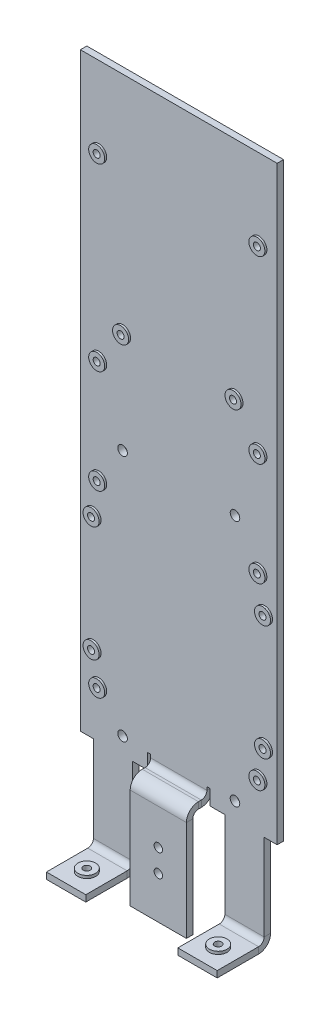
ISO-10303-21;
HEADER;
FILE_DESCRIPTION(('STEP AP214'),'2;1');
FILE_NAME('part.step','',(''),(''),'','','');
FILE_SCHEMA(('AUTOMOTIVE_DESIGN { 1 0 10303 214 1 1 1 1 }'));
ENDSEC;
DATA;
#1=APPLICATION_CONTEXT('core data for automotive mechanical design processes');
#2=APPLICATION_PROTOCOL_DEFINITION('international standard','automotive_design',2000,#1);
#3=PRODUCT_CONTEXT('',#1,'mechanical');
#4=PRODUCT('Part','Part','',(#3));
#5=PRODUCT_RELATED_PRODUCT_CATEGORY('part','',(#4));
#6=PRODUCT_DEFINITION_FORMATION('','',#4);
#7=PRODUCT_DEFINITION_CONTEXT('part definition',#1,'design');
#8=PRODUCT_DEFINITION('design','',#6,#7);
#9=PRODUCT_DEFINITION_SHAPE('','',#8);
#10=(LENGTH_UNIT() NAMED_UNIT(*) SI_UNIT(.MILLI.,.METRE.));
#11=(NAMED_UNIT(*) PLANE_ANGLE_UNIT() SI_UNIT($,.RADIAN.));
#12=(NAMED_UNIT(*) SI_UNIT($,.STERADIAN.) SOLID_ANGLE_UNIT());
#13=UNCERTAINTY_MEASURE_WITH_UNIT(LENGTH_MEASURE(1.E-05),#10,'distance_accuracy_value','');
#14=(GEOMETRIC_REPRESENTATION_CONTEXT(3) GLOBAL_UNCERTAINTY_ASSIGNED_CONTEXT((#13)) GLOBAL_UNIT_ASSIGNED_CONTEXT((#10,
#11,#12)) REPRESENTATION_CONTEXT('',''));
#15=CARTESIAN_POINT('',(0.,0.,0.));
#16=DIRECTION('',(0.,0.,1.));
#17=DIRECTION('',(1.,0.,0.));
#18=AXIS2_PLACEMENT_3D('',#15,#16,#17);
#19=CARTESIAN_POINT('',(0.,0.,-2.286));
#20=DIRECTION('',(0.,0.,-1.));
#21=DIRECTION('',(-1.,0.,0.));
#22=AXIS2_PLACEMENT_3D('',#19,#20,#21);
#23=PLANE('',#22);
#24=CARTESIAN_POINT('',(-28.5,-33.0769879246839,-2.286));
#25=DIRECTION('',(0.,0.,1.));
#26=DIRECTION('',(1.,0.,0.));
#27=AXIS2_PLACEMENT_3D('',#24,#25,#26);
#28=CIRCLE('',#27,1.25);
#29=CARTESIAN_POINT('',(-27.25,-33.0769879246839,-2.286));
#30=VERTEX_POINT('',#29);
#31=EDGE_CURVE('E662',#30,#30,#28,.T.);
#32=ORIENTED_EDGE('',*,*,#31,.T.);
#33=EDGE_LOOP('',(#32));
#34=FACE_BOUND('',#33,.T.);
#35=CARTESIAN_POINT('',(28.5,-33.0769879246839,-2.286));
#36=DIRECTION('',(0.,0.,1.));
#37=DIRECTION('',(1.,0.,0.));
#38=AXIS2_PLACEMENT_3D('',#35,#36,#37);
#39=CIRCLE('',#38,1.25);
#40=CARTESIAN_POINT('',(29.75,-33.0769879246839,-2.286));
#41=VERTEX_POINT('',#40);
#42=EDGE_CURVE('E668',#41,#41,#39,.T.);
#43=ORIENTED_EDGE('',*,*,#42,.T.);
#44=EDGE_LOOP('',(#43));
#45=FACE_BOUND('',#44,.T.);
#46=CARTESIAN_POINT('',(28.5,30.6688901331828,-2.286));
#47=DIRECTION('',(0.,0.,1.));
#48=DIRECTION('',(1.,0.,0.));
#49=AXIS2_PLACEMENT_3D('',#46,#47,#48);
#50=CIRCLE('',#49,1.25);
#51=CARTESIAN_POINT('',(29.75,30.6688901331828,-2.286));
#52=VERTEX_POINT('',#51);
#53=EDGE_CURVE('E674',#52,#52,#50,.T.);
#54=ORIENTED_EDGE('',*,*,#53,.T.);
#55=EDGE_LOOP('',(#54));
#56=FACE_BOUND('',#55,.T.);
#57=CARTESIAN_POINT('',(-28.5,30.6688901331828,-2.286));
#58=DIRECTION('',(0.,0.,1.));
#59=DIRECTION('',(1.,0.,0.));
#60=AXIS2_PLACEMENT_3D('',#57,#58,#59);
#61=CIRCLE('',#60,1.25);
#62=CARTESIAN_POINT('',(-27.25,30.6688901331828,-2.286));
#63=VERTEX_POINT('',#62);
#64=EDGE_CURVE('E680',#63,#63,#61,.T.);
#65=ORIENTED_EDGE('',*,*,#64,.T.);
#66=EDGE_LOOP('',(#65));
#67=FACE_BOUND('',#66,.T.);
#68=CARTESIAN_POINT('',(20.,80.,-2.286));
#69=DIRECTION('',(0.,0.,1.));
#70=DIRECTION('',(1.,0.,0.));
#71=AXIS2_PLACEMENT_3D('',#68,#69,#70);
#72=CIRCLE('',#71,1.25);
#73=CARTESIAN_POINT('',(21.25,80.,-2.286));
#74=VERTEX_POINT('',#73);
#75=EDGE_CURVE('E686',#74,#74,#72,.T.);
#76=ORIENTED_EDGE('',*,*,#75,.T.);
#77=EDGE_LOOP('',(#76));
#78=FACE_BOUND('',#77,.T.);
#79=CARTESIAN_POINT('',(-20.,80.,-2.286));
#80=DIRECTION('',(0.,0.,1.));
#81=DIRECTION('',(1.,0.,0.));
#82=AXIS2_PLACEMENT_3D('',#79,#80,#81);
#83=CIRCLE('',#82,1.25);
#84=CARTESIAN_POINT('',(-18.75,80.,-2.286));
#85=VERTEX_POINT('',#84);
#86=EDGE_CURVE('E692',#85,#85,#83,.T.);
#87=ORIENTED_EDGE('',*,*,#86,.T.);
#88=EDGE_LOOP('',(#87));
#89=FACE_BOUND('',#88,.T.);
#90=CARTESIAN_POINT('',(-30.5,-22.3385990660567,-2.286));
#91=DIRECTION('',(0.,0.,1.));
#92=DIRECTION('',(1.,0.,0.));
#93=AXIS2_PLACEMENT_3D('',#90,#91,#92);
#94=CIRCLE('',#93,1.25);
#95=CARTESIAN_POINT('',(-29.25,-22.3385990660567,-2.286));
#96=VERTEX_POINT('',#95);
#97=EDGE_CURVE('E698',#96,#96,#94,.T.);
#98=ORIENTED_EDGE('',*,*,#97,.T.);
#99=EDGE_LOOP('',(#98));
#100=FACE_BOUND('',#99,.T.);
#101=CARTESIAN_POINT('',(-30.5,18.6614009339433,-2.286));
#102=DIRECTION('',(0.,0.,1.));
#103=DIRECTION('',(1.,0.,0.));
#104=AXIS2_PLACEMENT_3D('',#101,#102,#103);
#105=CIRCLE('',#104,1.25);
#106=CARTESIAN_POINT('',(-29.25,18.6614009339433,-2.286));
#107=VERTEX_POINT('',#106);
#108=EDGE_CURVE('E704',#107,#107,#105,.T.);
#109=ORIENTED_EDGE('',*,*,#108,.T.);
#110=EDGE_LOOP('',(#109));
#111=FACE_BOUND('',#110,.T.);
#112=CARTESIAN_POINT('',(30.5,18.6614009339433,-2.286));
#113=DIRECTION('',(0.,0.,1.));
#114=DIRECTION('',(1.,0.,0.));
#115=AXIS2_PLACEMENT_3D('',#112,#113,#114);
#116=CIRCLE('',#115,1.25);
#117=CARTESIAN_POINT('',(31.75,18.6614009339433,-2.286));
#118=VERTEX_POINT('',#117);
#119=EDGE_CURVE('E710',#118,#118,#116,.T.);
#120=ORIENTED_EDGE('',*,*,#119,.T.);
#121=EDGE_LOOP('',(#120));
#122=FACE_BOUND('',#121,.T.);
#123=CARTESIAN_POINT('',(30.5,-22.3385990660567,-2.286));
#124=DIRECTION('',(0.,0.,1.));
#125=DIRECTION('',(1.,0.,0.));
#126=AXIS2_PLACEMENT_3D('',#123,#124,#125);
#127=CIRCLE('',#126,1.25);
#128=CARTESIAN_POINT('',(31.75,-22.3385990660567,-2.286));
#129=VERTEX_POINT('',#128);
#130=EDGE_CURVE('E716',#129,#129,#127,.T.);
#131=ORIENTED_EDGE('',*,*,#130,.T.);
#132=EDGE_LOOP('',(#131));
#133=FACE_BOUND('',#132,.T.);
#134=CARTESIAN_POINT('',(28.5,67.5,-2.286));
#135=DIRECTION('',(0.,0.,1.));
#136=DIRECTION('',(1.,0.,0.));
#137=AXIS2_PLACEMENT_3D('',#134,#135,#136);
#138=CIRCLE('',#137,1.25);
#139=CARTESIAN_POINT('',(29.75,67.5,-2.286));
#140=VERTEX_POINT('',#139);
#141=EDGE_CURVE('E722',#140,#140,#138,.T.);
#142=ORIENTED_EDGE('',*,*,#141,.T.);
#143=EDGE_LOOP('',(#142));
#144=FACE_BOUND('',#143,.T.);
#145=CARTESIAN_POINT('',(-28.5,67.5,-2.286));
#146=DIRECTION('',(0.,0.,1.));
#147=DIRECTION('',(1.,0.,0.));
#148=AXIS2_PLACEMENT_3D('',#145,#146,#147);
#149=CIRCLE('',#148,1.25);
#150=CARTESIAN_POINT('',(-27.25,67.5,-2.286));
#151=VERTEX_POINT('',#150);
#152=EDGE_CURVE('E728',#151,#151,#149,.T.);
#153=ORIENTED_EDGE('',*,*,#152,.T.);
#154=EDGE_LOOP('',(#153));
#155=FACE_BOUND('',#154,.T.);
#156=CARTESIAN_POINT('',(-20.,-44.,-2.286));
#157=DIRECTION('',(0.,0.,1.));
#158=DIRECTION('',(1.,0.,0.));
#159=AXIS2_PLACEMENT_3D('',#156,#157,#158);
#160=CIRCLE('',#159,1.69999999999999);
#161=CARTESIAN_POINT('',(-18.3,-44.,-2.286));
#162=VERTEX_POINT('',#161);
#163=EDGE_CURVE('E818',#162,#162,#160,.T.);
#164=ORIENTED_EDGE('',*,*,#163,.T.);
#165=EDGE_LOOP('',(#164));
#166=FACE_BOUND('',#165,.T.);
#167=CARTESIAN_POINT('',(20.,-44.,-2.286));
#168=DIRECTION('',(0.,0.,1.));
#169=DIRECTION('',(1.,0.,0.));
#170=AXIS2_PLACEMENT_3D('',#167,#168,#169);
#171=CIRCLE('',#170,1.69999999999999);
#172=CARTESIAN_POINT('',(21.7,-44.,-2.286));
#173=VERTEX_POINT('',#172);
#174=EDGE_CURVE('E812',#173,#173,#171,.T.);
#175=ORIENTED_EDGE('',*,*,#174,.T.);
#176=EDGE_LOOP('',(#175));
#177=FACE_BOUND('',#176,.T.);
#178=CARTESIAN_POINT('',(20.,44.,-2.286));
#179=DIRECTION('',(0.,0.,1.));
#180=DIRECTION('',(1.,0.,0.));
#181=AXIS2_PLACEMENT_3D('',#178,#179,#180);
#182=CIRCLE('',#181,1.69999999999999);
#183=CARTESIAN_POINT('',(21.7,44.,-2.286));
#184=VERTEX_POINT('',#183);
#185=EDGE_CURVE('E806',#184,#184,#182,.T.);
#186=ORIENTED_EDGE('',*,*,#185,.T.);
#187=EDGE_LOOP('',(#186));
#188=FACE_BOUND('',#187,.T.);
#189=CARTESIAN_POINT('',(-20.,44.,-2.286));
#190=DIRECTION('',(0.,0.,1.));
#191=DIRECTION('',(1.,0.,0.));
#192=AXIS2_PLACEMENT_3D('',#189,#190,#191);
#193=CIRCLE('',#192,1.69999999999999);
#194=CARTESIAN_POINT('',(-18.3,44.,-2.286));
#195=VERTEX_POINT('',#194);
#196=EDGE_CURVE('E800',#195,#195,#193,.T.);
#197=ORIENTED_EDGE('',*,*,#196,.T.);
#198=EDGE_LOOP('',(#197));
#199=FACE_BOUND('',#198,.T.);
#200=CARTESIAN_POINT('',(-28.5,131.5,-2.286));
#201=DIRECTION('',(0.,0.,1.));
#202=DIRECTION('',(1.,0.,0.));
#203=AXIS2_PLACEMENT_3D('',#200,#201,#202);
#204=CIRCLE('',#203,1.25);
#205=CARTESIAN_POINT('',(-27.25,131.5,-2.286));
#206=VERTEX_POINT('',#205);
#207=EDGE_CURVE('E740',#206,#206,#204,.T.);
#208=ORIENTED_EDGE('',*,*,#207,.T.);
#209=EDGE_LOOP('',(#208));
#210=FACE_BOUND('',#209,.T.);
#211=CARTESIAN_POINT('',(28.5,131.5,-2.286));
#212=DIRECTION('',(0.,0.,1.));
#213=DIRECTION('',(1.,0.,0.));
#214=AXIS2_PLACEMENT_3D('',#211,#212,#213);
#215=CIRCLE('',#214,1.25);
#216=CARTESIAN_POINT('',(29.75,131.5,-2.286));
#217=VERTEX_POINT('',#216);
#218=EDGE_CURVE('E734',#217,#217,#215,.T.);
#219=ORIENTED_EDGE('',*,*,#218,.T.);
#220=EDGE_LOOP('',(#219));
#221=FACE_BOUND('',#220,.T.);
#222=DIRECTION('',(0.,1.,0.));
#223=VECTOR('',#222,1.);
#224=CARTESIAN_POINT('',(-16.3811190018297,-50.,-2.286));
#225=LINE('',#224,#223);
#226=CARTESIAN_POINT('',(-16.3811190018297,-80.714,-2.28600000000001));
#227=VERTEX_POINT('',#226);
#228=CARTESIAN_POINT('',(-16.3811190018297,-50.,-2.286));
#229=VERTEX_POINT('',#228);
#230=EDGE_CURVE('E470',#227,#229,#225,.T.);
#231=ORIENTED_EDGE('',*,*,#230,.F.);
#232=DIRECTION('',(1.,0.,0.));
#233=VECTOR('',#232,1.);
#234=CARTESIAN_POINT('',(-16.3811190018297,-80.714,-2.28600000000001));
#235=LINE('',#234,#233);
#236=CARTESIAN_POINT('',(-30.3811190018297,-80.714,-2.286));
#237=VERTEX_POINT('',#236);
#238=EDGE_CURVE('E390',#227,#237,#235,.F.);
#239=ORIENTED_EDGE('',*,*,#238,.T.);
#240=DIRECTION('',(0.,-1.,0.));
#241=VECTOR('',#240,1.);
#242=CARTESIAN_POINT('',(-30.3811190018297,-50.,-2.286));
#243=LINE('',#242,#241);
#244=CARTESIAN_POINT('',(-30.3811190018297,-50.,-2.286));
#245=VERTEX_POINT('',#244);
#246=EDGE_CURVE('E467',#245,#237,#243,.T.);
#247=ORIENTED_EDGE('',*,*,#246,.F.);
#248=DIRECTION('',(1.,0.,0.));
#249=VECTOR('',#248,1.);
#250=CARTESIAN_POINT('',(-35.,-50.,-2.286));
#251=LINE('',#250,#249);
#252=CARTESIAN_POINT('',(-35.,-50.,-2.286));
#253=VERTEX_POINT('',#252);
#254=EDGE_CURVE('E829',#253,#245,#251,.T.);
#255=ORIENTED_EDGE('',*,*,#254,.F.);
#256=DIRECTION('',(0.,-1.,0.));
#257=VECTOR('',#256,1.);
#258=CARTESIAN_POINT('',(-35.,-50.,-2.286));
#259=LINE('',#258,#257);
#260=CARTESIAN_POINT('',(-35.,160.,-2.286));
#261=VERTEX_POINT('',#260);
#262=EDGE_CURVE('E824',#261,#253,#259,.T.);
#263=ORIENTED_EDGE('',*,*,#262,.F.);
#264=DIRECTION('',(1.,0.,0.));
#265=VECTOR('',#264,1.);
#266=CARTESIAN_POINT('',(35.,160.,-2.286));
#267=LINE('',#266,#265);
#268=CARTESIAN_POINT('',(35.,160.,-2.286));
#269=VERTEX_POINT('',#268);
#270=EDGE_CURVE('E785',#261,#269,#267,.T.);
#271=ORIENTED_EDGE('',*,*,#270,.T.);
#272=DIRECTION('',(0.,1.,0.));
#273=VECTOR('',#272,1.);
#274=CARTESIAN_POINT('',(35.,-50.,-2.286));
#275=LINE('',#274,#273);
#276=CARTESIAN_POINT('',(35.,-50.,-2.286));
#277=VERTEX_POINT('',#276);
#278=EDGE_CURVE('E822',#277,#269,#275,.T.);
#279=ORIENTED_EDGE('',*,*,#278,.F.);
#280=CARTESIAN_POINT('',(30.3811190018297,-50.,-2.286));
#281=VERTEX_POINT('',#280);
#282=EDGE_CURVE('E828',#281,#277,#251,.T.);
#283=ORIENTED_EDGE('',*,*,#282,.F.);
#284=DIRECTION('',(0.,1.,0.));
#285=VECTOR('',#284,1.);
#286=CARTESIAN_POINT('',(30.3811190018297,-50.,-2.286));
#287=LINE('',#286,#285);
#288=CARTESIAN_POINT('',(30.3811190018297,-80.714,-2.28600000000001));
#289=VERTEX_POINT('',#288);
#290=EDGE_CURVE('E484',#289,#281,#287,.T.);
#291=ORIENTED_EDGE('',*,*,#290,.F.);
#292=DIRECTION('',(1.,0.,0.));
#293=VECTOR('',#292,1.);
#294=CARTESIAN_POINT('',(30.3811190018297,-80.714,-2.28600000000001));
#295=LINE('',#294,#293);
#296=CARTESIAN_POINT('',(16.3811190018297,-80.714,-2.286));
#297=VERTEX_POINT('',#296);
#298=EDGE_CURVE('E444',#289,#297,#295,.F.);
#299=ORIENTED_EDGE('',*,*,#298,.T.);
#300=DIRECTION('',(0.,-1.,0.));
#301=VECTOR('',#300,1.);
#302=CARTESIAN_POINT('',(16.3811190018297,-50.,-2.286));
#303=LINE('',#302,#301);
#304=CARTESIAN_POINT('',(16.3811190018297,-50.,-2.286));
#305=VERTEX_POINT('',#304);
#306=EDGE_CURVE('E481',#305,#297,#303,.T.);
#307=ORIENTED_EDGE('',*,*,#306,.F.);
#308=CARTESIAN_POINT('',(11.143,-50.,-2.286));
#309=VERTEX_POINT('',#308);
#310=EDGE_CURVE('E834',#309,#305,#251,.T.);
#311=ORIENTED_EDGE('',*,*,#310,.F.);
#312=DIRECTION('',(0.,1.,0.));
#313=VECTOR('',#312,1.);
#314=CARTESIAN_POINT('',(11.143,0.,-2.286));
#315=LINE('',#314,#313);
#316=CARTESIAN_POINT('',(11.143,-44.571,-2.286));
#317=VERTEX_POINT('',#316);
#318=EDGE_CURVE('E657',#309,#317,#315,.T.);
#319=ORIENTED_EDGE('',*,*,#318,.T.);
#320=DIRECTION('',(-1.,0.,0.));
#321=VECTOR('',#320,1.);
#322=CARTESIAN_POINT('',(0.,-44.571,-2.286));
#323=LINE('',#322,#321);
#324=CARTESIAN_POINT('',(10.,-44.571,-2.286));
#325=VERTEX_POINT('',#324);
#326=EDGE_CURVE('E655',#317,#325,#323,.T.);
#327=ORIENTED_EDGE('',*,*,#326,.T.);
#328=DIRECTION('',(0.,-1.,0.));
#329=VECTOR('',#328,1.);
#330=CARTESIAN_POINT('',(10.,0.,-2.286));
#331=LINE('',#330,#329);
#332=CARTESIAN_POINT('',(10.,-45.714,-2.286));
#333=VERTEX_POINT('',#332);
#334=EDGE_CURVE('E652',#325,#333,#331,.T.);
#335=ORIENTED_EDGE('',*,*,#334,.T.);
#336=DIRECTION('',(1.,0.,0.));
#337=VECTOR('',#336,1.);
#338=CARTESIAN_POINT('',(10.,-45.714,-2.286));
#339=LINE('',#338,#337);
#340=CARTESIAN_POINT('',(-10.,-45.714,-2.286));
#341=VERTEX_POINT('',#340);
#342=EDGE_CURVE('E588',#333,#341,#339,.F.);
#343=ORIENTED_EDGE('',*,*,#342,.T.);
#344=DIRECTION('',(0.,1.,0.));
#345=VECTOR('',#344,1.);
#346=CARTESIAN_POINT('',(-10.,0.,-2.286));
#347=LINE('',#346,#345);
#348=CARTESIAN_POINT('',(-10.,-44.571,-2.286));
#349=VERTEX_POINT('',#348);
#350=EDGE_CURVE('E650',#341,#349,#347,.T.);
#351=ORIENTED_EDGE('',*,*,#350,.T.);
#352=DIRECTION('',(-1.,0.,0.));
#353=VECTOR('',#352,1.);
#354=CARTESIAN_POINT('',(0.,-44.571,-2.286));
#355=LINE('',#354,#353);
#356=CARTESIAN_POINT('',(-11.143,-44.571,-2.286));
#357=VERTEX_POINT('',#356);
#358=EDGE_CURVE('E648',#349,#357,#355,.T.);
#359=ORIENTED_EDGE('',*,*,#358,.T.);
#360=DIRECTION('',(0.,-1.,0.));
#361=VECTOR('',#360,1.);
#362=CARTESIAN_POINT('',(-11.143,0.,-2.286));
#363=LINE('',#362,#361);
#364=CARTESIAN_POINT('',(-11.143,-50.,-2.286));
#365=VERTEX_POINT('',#364);
#366=EDGE_CURVE('E614',#357,#365,#363,.T.);
#367=ORIENTED_EDGE('',*,*,#366,.T.);
#368=EDGE_CURVE('E833',#229,#365,#251,.T.);
#369=ORIENTED_EDGE('',*,*,#368,.F.);
#370=EDGE_LOOP('',(#231,#239,#247,#255,#263,#271,#279,#283,#291,#299,#307,#311,#319,#327,#335,
#343,#351,#359,#367,#369));
#371=FACE_BOUND('',#370,.T.);
#372=ADVANCED_FACE('F114',(#34,#45,#56,#67,#78,#89,#100,#111,#122,#133,#144,#155,#166,#177,#188,
#199,#210,#221,#371),#23,.T.);
#373=CARTESIAN_POINT('',(0.,0.,0.));
#374=DIRECTION('',(0.,0.,-1.));
#375=DIRECTION('',(-1.,0.,0.));
#376=AXIS2_PLACEMENT_3D('',#373,#374,#375);
#377=PLANE('',#376);
#378=CARTESIAN_POINT('',(-20.,-44.,0.));
#379=DIRECTION('',(0.,0.,1.));
#380=DIRECTION('',(1.,0.,0.));
#381=AXIS2_PLACEMENT_3D('',#378,#379,#380);
#382=CIRCLE('',#381,1.69999999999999);
#383=CARTESIAN_POINT('',(-18.3,-44.,0.));
#384=VERTEX_POINT('',#383);
#385=EDGE_CURVE('E815',#384,#384,#382,.T.);
#386=ORIENTED_EDGE('',*,*,#385,.F.);
#387=EDGE_LOOP('',(#386));
#388=FACE_BOUND('',#387,.T.);
#389=CARTESIAN_POINT('',(20.,-44.,0.));
#390=DIRECTION('',(0.,0.,1.));
#391=DIRECTION('',(1.,0.,0.));
#392=AXIS2_PLACEMENT_3D('',#389,#390,#391);
#393=CIRCLE('',#392,1.69999999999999);
#394=CARTESIAN_POINT('',(21.7,-44.,0.));
#395=VERTEX_POINT('',#394);
#396=EDGE_CURVE('E809',#395,#395,#393,.T.);
#397=ORIENTED_EDGE('',*,*,#396,.F.);
#398=EDGE_LOOP('',(#397));
#399=FACE_BOUND('',#398,.T.);
#400=CARTESIAN_POINT('',(20.,44.,0.));
#401=DIRECTION('',(0.,0.,1.));
#402=DIRECTION('',(1.,0.,0.));
#403=AXIS2_PLACEMENT_3D('',#400,#401,#402);
#404=CIRCLE('',#403,1.69999999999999);
#405=CARTESIAN_POINT('',(21.7,44.,0.));
#406=VERTEX_POINT('',#405);
#407=EDGE_CURVE('E803',#406,#406,#404,.T.);
#408=ORIENTED_EDGE('',*,*,#407,.F.);
#409=EDGE_LOOP('',(#408));
#410=FACE_BOUND('',#409,.T.);
#411=CARTESIAN_POINT('',(-20.,44.,0.));
#412=DIRECTION('',(0.,0.,1.));
#413=DIRECTION('',(1.,0.,0.));
#414=AXIS2_PLACEMENT_3D('',#411,#412,#413);
#415=CIRCLE('',#414,1.69999999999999);
#416=CARTESIAN_POINT('',(-18.3,44.,0.));
#417=VERTEX_POINT('',#416);
#418=EDGE_CURVE('E795',#417,#417,#415,.T.);
#419=ORIENTED_EDGE('',*,*,#418,.F.);
#420=EDGE_LOOP('',(#419));
#421=FACE_BOUND('',#420,.T.);
#422=CARTESIAN_POINT('',(28.5,30.6688901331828,0.));
#423=DIRECTION('',(0.,0.,-1.));
#424=DIRECTION('',(-1.,0.,0.));
#425=AXIS2_PLACEMENT_3D('',#422,#423,#424);
#426=CIRCLE('',#425,2.85);
#427=CARTESIAN_POINT('',(25.65,30.6688901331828,0.));
#428=VERTEX_POINT('',#427);
#429=EDGE_CURVE('E847',#428,#428,#426,.F.);
#430=ORIENTED_EDGE('',*,*,#429,.F.);
#431=EDGE_LOOP('',(#430));
#432=FACE_BOUND('',#431,.T.);
#433=CARTESIAN_POINT('',(28.5,-33.0769879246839,0.));
#434=DIRECTION('',(0.,0.,-1.));
#435=DIRECTION('',(-1.,0.,0.));
#436=AXIS2_PLACEMENT_3D('',#433,#434,#435);
#437=CIRCLE('',#436,2.85);
#438=CARTESIAN_POINT('',(25.65,-33.0769879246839,0.));
#439=VERTEX_POINT('',#438);
#440=EDGE_CURVE('E851',#439,#439,#437,.F.);
#441=ORIENTED_EDGE('',*,*,#440,.F.);
#442=EDGE_LOOP('',(#441));
#443=FACE_BOUND('',#442,.T.);
#444=CARTESIAN_POINT('',(-28.5,-33.0769879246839,0.));
#445=DIRECTION('',(0.,0.,-1.));
#446=DIRECTION('',(-1.,0.,0.));
#447=AXIS2_PLACEMENT_3D('',#444,#445,#446);
#448=CIRCLE('',#447,2.85);
#449=CARTESIAN_POINT('',(-31.35,-33.0769879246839,0.));
#450=VERTEX_POINT('',#449);
#451=EDGE_CURVE('E854',#450,#450,#448,.F.);
#452=ORIENTED_EDGE('',*,*,#451,.F.);
#453=EDGE_LOOP('',(#452));
#454=FACE_BOUND('',#453,.T.);
#455=CARTESIAN_POINT('',(-28.5,30.6688901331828,0.));
#456=DIRECTION('',(0.,0.,-1.));
#457=DIRECTION('',(-1.,0.,0.));
#458=AXIS2_PLACEMENT_3D('',#455,#456,#457);
#459=CIRCLE('',#458,2.85);
#460=CARTESIAN_POINT('',(-31.35,30.6688901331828,0.));
#461=VERTEX_POINT('',#460);
#462=EDGE_CURVE('E857',#461,#461,#459,.F.);
#463=ORIENTED_EDGE('',*,*,#462,.F.);
#464=EDGE_LOOP('',(#463));
#465=FACE_BOUND('',#464,.T.);
#466=CARTESIAN_POINT('',(-20.,80.,0.));
#467=DIRECTION('',(0.,0.,-1.));
#468=DIRECTION('',(-1.,0.,0.));
#469=AXIS2_PLACEMENT_3D('',#466,#467,#468);
#470=CIRCLE('',#469,2.85000000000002);
#471=CARTESIAN_POINT('',(-22.85,80.,0.));
#472=VERTEX_POINT('',#471);
#473=EDGE_CURVE('E860',#472,#472,#470,.F.);
#474=ORIENTED_EDGE('',*,*,#473,.F.);
#475=EDGE_LOOP('',(#474));
#476=FACE_BOUND('',#475,.T.);
#477=CARTESIAN_POINT('',(20.,80.,0.));
#478=DIRECTION('',(0.,0.,-1.));
#479=DIRECTION('',(-1.,0.,0.));
#480=AXIS2_PLACEMENT_3D('',#477,#478,#479);
#481=CIRCLE('',#480,2.85000000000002);
#482=CARTESIAN_POINT('',(17.15,80.,0.));
#483=VERTEX_POINT('',#482);
#484=EDGE_CURVE('E863',#483,#483,#481,.F.);
#485=ORIENTED_EDGE('',*,*,#484,.F.);
#486=EDGE_LOOP('',(#485));
#487=FACE_BOUND('',#486,.T.);
#488=CARTESIAN_POINT('',(30.5,18.6614009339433,0.));
#489=DIRECTION('',(0.,0.,-1.));
#490=DIRECTION('',(-1.,0.,0.));
#491=AXIS2_PLACEMENT_3D('',#488,#489,#490);
#492=CIRCLE('',#491,2.85);
#493=CARTESIAN_POINT('',(27.65,18.6614009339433,0.));
#494=VERTEX_POINT('',#493);
#495=EDGE_CURVE('E866',#494,#494,#492,.F.);
#496=ORIENTED_EDGE('',*,*,#495,.F.);
#497=EDGE_LOOP('',(#496));
#498=FACE_BOUND('',#497,.T.);
#499=CARTESIAN_POINT('',(30.5,-22.3385990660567,0.));
#500=DIRECTION('',(0.,0.,-1.));
#501=DIRECTION('',(-1.,0.,0.));
#502=AXIS2_PLACEMENT_3D('',#499,#500,#501);
#503=CIRCLE('',#502,2.85);
#504=CARTESIAN_POINT('',(27.65,-22.3385990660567,0.));
#505=VERTEX_POINT('',#504);
#506=EDGE_CURVE('E869',#505,#505,#503,.F.);
#507=ORIENTED_EDGE('',*,*,#506,.F.);
#508=EDGE_LOOP('',(#507));
#509=FACE_BOUND('',#508,.T.);
#510=CARTESIAN_POINT('',(-30.5,-22.3385990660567,0.));
#511=DIRECTION('',(0.,0.,-1.));
#512=DIRECTION('',(-1.,0.,0.));
#513=AXIS2_PLACEMENT_3D('',#510,#511,#512);
#514=CIRCLE('',#513,2.85);
#515=CARTESIAN_POINT('',(-33.35,-22.3385990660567,0.));
#516=VERTEX_POINT('',#515);
#517=EDGE_CURVE('E872',#516,#516,#514,.F.);
#518=ORIENTED_EDGE('',*,*,#517,.F.);
#519=EDGE_LOOP('',(#518));
#520=FACE_BOUND('',#519,.T.);
#521=CARTESIAN_POINT('',(-30.5,18.6614009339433,0.));
#522=DIRECTION('',(0.,0.,-1.));
#523=DIRECTION('',(-1.,0.,0.));
#524=AXIS2_PLACEMENT_3D('',#521,#522,#523);
#525=CIRCLE('',#524,2.85);
#526=CARTESIAN_POINT('',(-33.35,18.6614009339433,0.));
#527=VERTEX_POINT('',#526);
#528=EDGE_CURVE('E875',#527,#527,#525,.F.);
#529=ORIENTED_EDGE('',*,*,#528,.F.);
#530=EDGE_LOOP('',(#529));
#531=FACE_BOUND('',#530,.T.);
#532=CARTESIAN_POINT('',(-28.5,67.5,0.));
#533=DIRECTION('',(0.,0.,-1.));
#534=DIRECTION('',(-1.,0.,0.));
#535=AXIS2_PLACEMENT_3D('',#532,#533,#534);
#536=CIRCLE('',#535,2.85);
#537=CARTESIAN_POINT('',(-31.35,67.5,0.));
#538=VERTEX_POINT('',#537);
#539=EDGE_CURVE('E878',#538,#538,#536,.F.);
#540=ORIENTED_EDGE('',*,*,#539,.F.);
#541=EDGE_LOOP('',(#540));
#542=FACE_BOUND('',#541,.T.);
#543=CARTESIAN_POINT('',(28.5,67.5,0.));
#544=DIRECTION('',(0.,0.,-1.));
#545=DIRECTION('',(-1.,0.,0.));
#546=AXIS2_PLACEMENT_3D('',#543,#544,#545);
#547=CIRCLE('',#546,2.85);
#548=CARTESIAN_POINT('',(25.65,67.5,0.));
#549=VERTEX_POINT('',#548);
#550=EDGE_CURVE('E881',#549,#549,#547,.F.);
#551=ORIENTED_EDGE('',*,*,#550,.F.);
#552=EDGE_LOOP('',(#551));
#553=FACE_BOUND('',#552,.T.);
#554=CARTESIAN_POINT('',(28.5,131.5,0.));
#555=DIRECTION('',(0.,0.,-1.));
#556=DIRECTION('',(-1.,0.,0.));
#557=AXIS2_PLACEMENT_3D('',#554,#555,#556);
#558=CIRCLE('',#557,2.84999999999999);
#559=CARTESIAN_POINT('',(25.65,131.5,0.));
#560=VERTEX_POINT('',#559);
#561=EDGE_CURVE('E884',#560,#560,#558,.F.);
#562=ORIENTED_EDGE('',*,*,#561,.F.);
#563=EDGE_LOOP('',(#562));
#564=FACE_BOUND('',#563,.T.);
#565=CARTESIAN_POINT('',(-28.5,131.5,0.));
#566=DIRECTION('',(0.,0.,-1.));
#567=DIRECTION('',(-1.,0.,0.));
#568=AXIS2_PLACEMENT_3D('',#565,#566,#567);
#569=CIRCLE('',#568,2.84999999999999);
#570=CARTESIAN_POINT('',(-31.35,131.5,0.));
#571=VERTEX_POINT('',#570);
#572=EDGE_CURVE('E887',#571,#571,#569,.F.);
#573=ORIENTED_EDGE('',*,*,#572,.F.);
#574=EDGE_LOOP('',(#573));
#575=FACE_BOUND('',#574,.T.);
#576=DIRECTION('',(1.,0.,0.));
#577=VECTOR('',#576,1.);
#578=CARTESIAN_POINT('',(-16.3811190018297,-80.714,0.));
#579=LINE('',#578,#577);
#580=CARTESIAN_POINT('',(-16.3811190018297,-80.714,0.));
#581=VERTEX_POINT('',#580);
#582=CARTESIAN_POINT('',(-30.3811190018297,-80.714,0.));
#583=VERTEX_POINT('',#582);
#584=EDGE_CURVE('E403',#581,#583,#579,.F.);
#585=ORIENTED_EDGE('',*,*,#584,.F.);
#586=DIRECTION('',(0.,1.,0.));
#587=VECTOR('',#586,1.);
#588=CARTESIAN_POINT('',(-16.3811190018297,-50.,0.));
#589=LINE('',#588,#587);
#590=CARTESIAN_POINT('',(-16.3811190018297,-50.,0.));
#591=VERTEX_POINT('',#590);
#592=EDGE_CURVE('E129',#581,#591,#589,.T.);
#593=ORIENTED_EDGE('',*,*,#592,.T.);
#594=DIRECTION('',(1.,0.,0.));
#595=VECTOR('',#594,1.);
#596=CARTESIAN_POINT('',(-35.,-50.,0.));
#597=LINE('',#596,#595);
#598=CARTESIAN_POINT('',(-11.143,-50.,0.));
#599=VERTEX_POINT('',#598);
#600=EDGE_CURVE('E842',#591,#599,#597,.T.);
#601=ORIENTED_EDGE('',*,*,#600,.T.);
#602=DIRECTION('',(0.,-1.,0.));
#603=VECTOR('',#602,1.);
#604=CARTESIAN_POINT('',(-11.143,-44.571,0.));
#605=LINE('',#604,#603);
#606=CARTESIAN_POINT('',(-11.143,-44.571,0.));
#607=VERTEX_POINT('',#606);
#608=EDGE_CURVE('E631',#607,#599,#605,.T.);
#609=ORIENTED_EDGE('',*,*,#608,.F.);
#610=DIRECTION('',(-1.,0.,0.));
#611=VECTOR('',#610,1.);
#612=CARTESIAN_POINT('',(-10.,-44.571,0.));
#613=LINE('',#612,#611);
#614=CARTESIAN_POINT('',(-10.,-44.571,0.));
#615=VERTEX_POINT('',#614);
#616=EDGE_CURVE('E627',#615,#607,#613,.T.);
#617=ORIENTED_EDGE('',*,*,#616,.F.);
#618=DIRECTION('',(0.,1.,0.));
#619=VECTOR('',#618,1.);
#620=CARTESIAN_POINT('',(-10.,-45.714,0.));
#621=LINE('',#620,#619);
#622=CARTESIAN_POINT('',(-10.,-45.714,0.));
#623=VERTEX_POINT('',#622);
#624=EDGE_CURVE('E624',#623,#615,#621,.T.);
#625=ORIENTED_EDGE('',*,*,#624,.F.);
#626=DIRECTION('',(1.,0.,0.));
#627=VECTOR('',#626,1.);
#628=CARTESIAN_POINT('',(10.,-45.714,0.));
#629=LINE('',#628,#627);
#630=CARTESIAN_POINT('',(10.,-45.714,0.));
#631=VERTEX_POINT('',#630);
#632=EDGE_CURVE('E601',#631,#623,#629,.F.);
#633=ORIENTED_EDGE('',*,*,#632,.F.);
#634=DIRECTION('',(0.,-1.,0.));
#635=VECTOR('',#634,1.);
#636=CARTESIAN_POINT('',(10.,-44.571,0.));
#637=LINE('',#636,#635);
#638=CARTESIAN_POINT('',(10.,-44.571,0.));
#639=VERTEX_POINT('',#638);
#640=EDGE_CURVE('E620',#639,#631,#637,.T.);
#641=ORIENTED_EDGE('',*,*,#640,.F.);
#642=DIRECTION('',(-1.,0.,0.));
#643=VECTOR('',#642,1.);
#644=CARTESIAN_POINT('',(11.143,-44.571,0.));
#645=LINE('',#644,#643);
#646=CARTESIAN_POINT('',(11.143,-44.571,0.));
#647=VERTEX_POINT('',#646);
#648=EDGE_CURVE('E616',#647,#639,#645,.T.);
#649=ORIENTED_EDGE('',*,*,#648,.F.);
#650=DIRECTION('',(0.,1.,0.));
#651=VECTOR('',#650,1.);
#652=CARTESIAN_POINT('',(11.143,-50.,0.));
#653=LINE('',#652,#651);
#654=CARTESIAN_POINT('',(11.143,-50.,0.));
#655=VERTEX_POINT('',#654);
#656=EDGE_CURVE('E611',#655,#647,#653,.T.);
#657=ORIENTED_EDGE('',*,*,#656,.F.);
#658=CARTESIAN_POINT('',(16.3811190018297,-50.,0.));
#659=VERTEX_POINT('',#658);
#660=EDGE_CURVE('E843',#655,#659,#597,.T.);
#661=ORIENTED_EDGE('',*,*,#660,.T.);
#662=DIRECTION('',(0.,-1.,0.));
#663=VECTOR('',#662,1.);
#664=CARTESIAN_POINT('',(16.3811190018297,-50.,0.));
#665=LINE('',#664,#663);
#666=CARTESIAN_POINT('',(16.3811190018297,-80.714,0.));
#667=VERTEX_POINT('',#666);
#668=EDGE_CURVE('E478',#659,#667,#665,.T.);
#669=ORIENTED_EDGE('',*,*,#668,.T.);
#670=DIRECTION('',(1.,0.,0.));
#671=VECTOR('',#670,1.);
#672=CARTESIAN_POINT('',(30.3811190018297,-80.714,0.));
#673=LINE('',#672,#671);
#674=CARTESIAN_POINT('',(30.3811190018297,-80.714,0.));
#675=VERTEX_POINT('',#674);
#676=EDGE_CURVE('E457',#675,#667,#673,.F.);
#677=ORIENTED_EDGE('',*,*,#676,.F.);
#678=DIRECTION('',(0.,1.,0.));
#679=VECTOR('',#678,1.);
#680=CARTESIAN_POINT('',(30.3811190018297,-50.,0.));
#681=LINE('',#680,#679);
#682=CARTESIAN_POINT('',(30.3811190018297,-50.,0.));
#683=VERTEX_POINT('',#682);
#684=EDGE_CURVE('E136',#675,#683,#681,.T.);
#685=ORIENTED_EDGE('',*,*,#684,.T.);
#686=CARTESIAN_POINT('',(35.,-50.,0.));
#687=VERTEX_POINT('',#686);
#688=EDGE_CURVE('E839',#683,#687,#597,.T.);
#689=ORIENTED_EDGE('',*,*,#688,.T.);
#690=DIRECTION('',(0.,1.,0.));
#691=VECTOR('',#690,1.);
#692=CARTESIAN_POINT('',(35.,-50.,0.));
#693=LINE('',#692,#691);
#694=CARTESIAN_POINT('',(35.,160.,0.));
#695=VERTEX_POINT('',#694);
#696=EDGE_CURVE('E821',#687,#695,#693,.T.);
#697=ORIENTED_EDGE('',*,*,#696,.T.);
#698=DIRECTION('',(1.,0.,0.));
#699=VECTOR('',#698,1.);
#700=CARTESIAN_POINT('',(35.,160.,0.));
#701=LINE('',#700,#699);
#702=CARTESIAN_POINT('',(-35.,160.,0.));
#703=VERTEX_POINT('',#702);
#704=EDGE_CURVE('E786',#703,#695,#701,.T.);
#705=ORIENTED_EDGE('',*,*,#704,.F.);
#706=DIRECTION('',(0.,-1.,0.));
#707=VECTOR('',#706,1.);
#708=CARTESIAN_POINT('',(-35.,-50.,0.));
#709=LINE('',#708,#707);
#710=CARTESIAN_POINT('',(-35.,-50.,0.));
#711=VERTEX_POINT('',#710);
#712=EDGE_CURVE('E836',#703,#711,#709,.T.);
#713=ORIENTED_EDGE('',*,*,#712,.T.);
#714=CARTESIAN_POINT('',(-30.3811190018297,-50.,0.));
#715=VERTEX_POINT('',#714);
#716=EDGE_CURVE('E825',#711,#715,#597,.T.);
#717=ORIENTED_EDGE('',*,*,#716,.T.);
#718=DIRECTION('',(0.,-1.,0.));
#719=VECTOR('',#718,1.);
#720=CARTESIAN_POINT('',(-30.3811190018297,-50.,0.));
#721=LINE('',#720,#719);
#722=EDGE_CURVE('E464',#715,#583,#721,.T.);
#723=ORIENTED_EDGE('',*,*,#722,.T.);
#724=EDGE_LOOP('',(#585,#593,#601,#609,#617,#625,#633,#641,#649,#657,#661,#669,#677,#685,#689,
#697,#705,#713,#717,#723));
#725=FACE_BOUND('',#724,.T.);
#726=ADVANCED_FACE('F953',(#388,#399,#410,#421,#432,#443,#454,#465,#476,#487,#498,#509,#520,
#531,#542,#553,#564,#575,#725),#377,.F.);
#727=CARTESIAN_POINT('',(-16.3811190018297,-50.,-2.286));
#728=DIRECTION('',(1.,0.,0.));
#729=DIRECTION('',(0.,1.,0.));
#730=AXIS2_PLACEMENT_3D('',#727,#728,#729);
#731=PLANE('',#730);
#732=ORIENTED_EDGE('',*,*,#592,.F.);
#733=DIRECTION('',(0.,0.,-1.));
#734=VECTOR('',#733,1.);
#735=CARTESIAN_POINT('',(-16.3811190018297,-80.714,0.));
#736=LINE('',#735,#734);
#737=EDGE_CURVE('E397',#581,#227,#736,.T.);
#738=ORIENTED_EDGE('',*,*,#737,.T.);
#739=ORIENTED_EDGE('',*,*,#230,.T.);
#740=DIRECTION('',(0.,0.,1.));
#741=VECTOR('',#740,1.);
#742=CARTESIAN_POINT('',(-16.3811190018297,-50.,-2.286));
#743=LINE('',#742,#741);
#744=EDGE_CURVE('E476',#229,#591,#743,.T.);
#745=ORIENTED_EDGE('',*,*,#744,.T.);
#746=EDGE_LOOP('',(#732,#738,#739,#745));
#747=FACE_BOUND('',#746,.T.);
#748=ADVANCED_FACE('F959',(#747),#731,.T.);
#749=CARTESIAN_POINT('',(30.3811190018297,-50.,-2.286));
#750=DIRECTION('',(1.,0.,0.));
#751=DIRECTION('',(0.,0.,-1.));
#752=AXIS2_PLACEMENT_3D('',#749,#750,#751);
#753=PLANE('',#752);
#754=ORIENTED_EDGE('',*,*,#684,.F.);
#755=DIRECTION('',(0.,0.,-1.));
#756=VECTOR('',#755,1.);
#757=CARTESIAN_POINT('',(30.3811190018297,-80.714,0.));
#758=LINE('',#757,#756);
#759=EDGE_CURVE('E451',#675,#289,#758,.T.);
#760=ORIENTED_EDGE('',*,*,#759,.T.);
#761=ORIENTED_EDGE('',*,*,#290,.T.);
#762=DIRECTION('',(0.,0.,1.));
#763=VECTOR('',#762,1.);
#764=CARTESIAN_POINT('',(30.3811190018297,-50.,-2.286));
#765=LINE('',#764,#763);
#766=EDGE_CURVE('E486',#281,#683,#765,.T.);
#767=ORIENTED_EDGE('',*,*,#766,.T.);
#768=EDGE_LOOP('',(#754,#760,#761,#767));
#769=FACE_BOUND('',#768,.T.);
#770=ADVANCED_FACE('F1121',(#769),#753,.T.);
#771=CARTESIAN_POINT('',(-35.,-50.,-2.286));
#772=DIRECTION('',(0.,-1.,0.));
#773=DIRECTION('',(0.,0.,-1.));
#774=AXIS2_PLACEMENT_3D('',#771,#772,#773);
#775=PLANE('',#774);
#776=ORIENTED_EDGE('',*,*,#744,.F.);
#777=ORIENTED_EDGE('',*,*,#368,.T.);
#778=DIRECTION('',(0.,0.,-1.));
#779=VECTOR('',#778,1.);
#780=CARTESIAN_POINT('',(-11.143,-50.,0.));
#781=LINE('',#780,#779);
#782=EDGE_CURVE('E634',#599,#365,#781,.T.);
#783=ORIENTED_EDGE('',*,*,#782,.F.);
#784=ORIENTED_EDGE('',*,*,#600,.F.);
#785=EDGE_LOOP('',(#776,#777,#783,#784));
#786=FACE_BOUND('',#785,.T.);
#787=ADVANCED_FACE('F972',(#786),#775,.T.);
#788=DIRECTION('',(0.,0.,1.));
#789=VECTOR('',#788,1.);
#790=CARTESIAN_POINT('',(16.3811190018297,-50.,-2.286));
#791=LINE('',#790,#789);
#792=EDGE_CURVE('E490',#305,#659,#791,.T.);
#793=ORIENTED_EDGE('',*,*,#792,.T.);
#794=ORIENTED_EDGE('',*,*,#660,.F.);
#795=DIRECTION('',(0.,0.,-1.));
#796=VECTOR('',#795,1.);
#797=CARTESIAN_POINT('',(11.143,-50.,0.));
#798=LINE('',#797,#796);
#799=EDGE_CURVE('E615',#655,#309,#798,.T.);
#800=ORIENTED_EDGE('',*,*,#799,.T.);
#801=ORIENTED_EDGE('',*,*,#310,.T.);
#802=EDGE_LOOP('',(#793,#794,#800,#801));
#803=FACE_BOUND('',#802,.T.);
#804=ADVANCED_FACE('F1473',(#803),#775,.T.);
#805=CARTESIAN_POINT('',(-10.,-50.,4.99999999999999));
#806=DIRECTION('',(-1.,0.,0.));
#807=DIRECTION('',(0.,0.,1.));
#808=AXIS2_PLACEMENT_3D('',#805,#806,#807);
#809=PLANE('',#808);
#810=DIRECTION('',(0.,0.,1.));
#811=VECTOR('',#810,1.);
#812=CARTESIAN_POINT('',(-10.,-50.,4.99999999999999));
#813=LINE('',#812,#811);
#814=CARTESIAN_POINT('',(-10.,-50.,1.99999999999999));
#815=VERTEX_POINT('',#814);
#816=CARTESIAN_POINT('',(-10.,-50.,3.));
#817=VERTEX_POINT('',#816);
#818=EDGE_CURVE('E569',#815,#817,#813,.T.);
#819=ORIENTED_EDGE('',*,*,#818,.T.);
#820=DIRECTION('',(0.,1.,0.));
#821=VECTOR('',#820,1.);
#822=CARTESIAN_POINT('',(-10.,-50.,3.));
#823=LINE('',#822,#821);
#824=CARTESIAN_POINT('',(-10.,-47.714,3.00000000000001));
#825=VERTEX_POINT('',#824);
#826=EDGE_CURVE('E550',#817,#825,#823,.T.);
#827=ORIENTED_EDGE('',*,*,#826,.T.);
#828=DIRECTION('',(0.,0.,-1.));
#829=VECTOR('',#828,1.);
#830=CARTESIAN_POINT('',(-10.,-47.714,-2.1163626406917E-13));
#831=LINE('',#830,#829);
#832=CARTESIAN_POINT('',(-10.,-47.714,1.99999999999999));
#833=VERTEX_POINT('',#832);
#834=EDGE_CURVE('E574',#833,#825,#831,.F.);
#835=ORIENTED_EDGE('',*,*,#834,.F.);
#836=DIRECTION('',(0.,-1.,0.));
#837=VECTOR('',#836,1.);
#838=CARTESIAN_POINT('',(-10.,-50.,1.99999999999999));
#839=LINE('',#838,#837);
#840=EDGE_CURVE('E564',#833,#815,#839,.T.);
#841=ORIENTED_EDGE('',*,*,#840,.T.);
#842=EDGE_LOOP('',(#819,#827,#835,#841));
#843=FACE_BOUND('',#842,.T.);
#844=ADVANCED_FACE('F1615',(#843),#809,.T.);
#845=CARTESIAN_POINT('',(0.,-50.,-2.16148343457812E-13));
#846=DIRECTION('',(0.,-1.,0.));
#847=DIRECTION('',(0.,0.,-1.));
#848=AXIS2_PLACEMENT_3D('',#845,#846,#847);
#849=PLANE('',#848);
#850=DIRECTION('',(0.,0.,-1.));
#851=VECTOR('',#850,1.);
#852=CARTESIAN_POINT('',(10.,-50.,4.99999999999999));
#853=LINE('',#852,#851);
#854=CARTESIAN_POINT('',(10.,-50.,3.));
#855=VERTEX_POINT('',#854);
#856=CARTESIAN_POINT('',(10.,-50.,1.99999999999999));
#857=VERTEX_POINT('',#856);
#858=EDGE_CURVE('E566',#855,#857,#853,.T.);
#859=ORIENTED_EDGE('',*,*,#858,.F.);
#860=DIRECTION('',(-1.,0.,0.));
#861=VECTOR('',#860,1.);
#862=CARTESIAN_POINT('',(-10.,-50.,3.));
#863=LINE('',#862,#861);
#864=EDGE_CURVE('E556',#817,#855,#863,.F.);
#865=ORIENTED_EDGE('',*,*,#864,.F.);
#866=ORIENTED_EDGE('',*,*,#818,.F.);
#867=DIRECTION('',(1.,0.,0.));
#868=VECTOR('',#867,1.);
#869=CARTESIAN_POINT('',(0.,-50.,1.99999999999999));
#870=LINE('',#869,#868);
#871=EDGE_CURVE('E577',#815,#857,#870,.T.);
#872=ORIENTED_EDGE('',*,*,#871,.T.);
#873=EDGE_LOOP('',(#859,#865,#866,#872));
#874=FACE_BOUND('',#873,.T.);
#875=ADVANCED_FACE('F940',(#874),#849,.T.);
#876=CARTESIAN_POINT('',(0.,-47.714,-2.08166817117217E-13));
#877=DIRECTION('',(0.,-1.,0.));
#878=DIRECTION('',(0.,0.,-1.));
#879=AXIS2_PLACEMENT_3D('',#876,#877,#878);
#880=PLANE('',#879);
#881=DIRECTION('',(-1.,0.,0.));
#882=VECTOR('',#881,1.);
#883=CARTESIAN_POINT('',(-10.,-47.714,3.00000000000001));
#884=LINE('',#883,#882);
#885=CARTESIAN_POINT('',(10.,-47.714,3.));
#886=VERTEX_POINT('',#885);
#887=EDGE_CURVE('E544',#825,#886,#884,.F.);
#888=ORIENTED_EDGE('',*,*,#887,.T.);
#889=DIRECTION('',(0.,0.,1.));
#890=VECTOR('',#889,1.);
#891=CARTESIAN_POINT('',(10.,-47.714,-2.1163626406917E-13));
#892=LINE('',#891,#890);
#893=CARTESIAN_POINT('',(10.,-47.714,1.99999999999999));
#894=VERTEX_POINT('',#893);
#895=EDGE_CURVE('E572',#886,#894,#892,.F.);
#896=ORIENTED_EDGE('',*,*,#895,.T.);
#897=DIRECTION('',(-1.,0.,0.));
#898=VECTOR('',#897,1.);
#899=CARTESIAN_POINT('',(-10.,-47.714,1.99999999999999));
#900=LINE('',#899,#898);
#901=EDGE_CURVE('E583',#833,#894,#900,.F.);
#902=ORIENTED_EDGE('',*,*,#901,.F.);
#903=ORIENTED_EDGE('',*,*,#834,.T.);
#904=EDGE_LOOP('',(#888,#896,#902,#903));
#905=FACE_BOUND('',#904,.T.);
#906=ADVANCED_FACE('F970',(#905),#880,.F.);
#907=ORIENTED_EDGE('',*,*,#766,.F.);
#908=ORIENTED_EDGE('',*,*,#282,.T.);
#909=DIRECTION('',(0.,0.,1.));
#910=VECTOR('',#909,1.);
#911=CARTESIAN_POINT('',(35.,-50.,-2.286));
#912=LINE('',#911,#910);
#913=EDGE_CURVE('E844',#277,#687,#912,.T.);
#914=ORIENTED_EDGE('',*,*,#913,.T.);
#915=ORIENTED_EDGE('',*,*,#688,.F.);
#916=EDGE_LOOP('',(#907,#908,#914,#915));
#917=FACE_BOUND('',#916,.T.);
#918=ADVANCED_FACE('F967',(#917),#775,.T.);
#919=DIRECTION('',(0.,0.,1.));
#920=VECTOR('',#919,1.);
#921=CARTESIAN_POINT('',(-30.3811190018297,-50.,-2.286));
#922=LINE('',#921,#920);
#923=EDGE_CURVE('E472',#245,#715,#922,.T.);
#924=ORIENTED_EDGE('',*,*,#923,.T.);
#925=ORIENTED_EDGE('',*,*,#716,.F.);
#926=DIRECTION('',(0.,0.,1.));
#927=VECTOR('',#926,1.);
#928=CARTESIAN_POINT('',(-35.,-50.,-2.286));
#929=LINE('',#928,#927);
#930=EDGE_CURVE('E832',#253,#711,#929,.T.);
#931=ORIENTED_EDGE('',*,*,#930,.F.);
#932=ORIENTED_EDGE('',*,*,#254,.T.);
#933=EDGE_LOOP('',(#924,#925,#931,#932));
#934=FACE_BOUND('',#933,.T.);
#935=ADVANCED_FACE('F969',(#934),#775,.T.);
#936=CARTESIAN_POINT('',(35.,-50.,-2.286));
#937=DIRECTION('',(1.,0.,0.));
#938=DIRECTION('',(0.,0.,-1.));
#939=AXIS2_PLACEMENT_3D('',#936,#937,#938);
#940=PLANE('',#939);
#941=ORIENTED_EDGE('',*,*,#696,.F.);
#942=ORIENTED_EDGE('',*,*,#913,.F.);
#943=ORIENTED_EDGE('',*,*,#278,.T.);
#944=DIRECTION('',(0.,0.,-1.));
#945=VECTOR('',#944,1.);
#946=CARTESIAN_POINT('',(35.,160.,0.));
#947=LINE('',#946,#945);
#948=EDGE_CURVE('E792',#695,#269,#947,.T.);
#949=ORIENTED_EDGE('',*,*,#948,.F.);
#950=EDGE_LOOP('',(#941,#942,#943,#949));
#951=FACE_BOUND('',#950,.T.);
#952=ADVANCED_FACE('F116',(#951),#940,.T.);
#953=CARTESIAN_POINT('',(-35.,-50.,-2.286));
#954=DIRECTION('',(-1.,0.,0.));
#955=DIRECTION('',(0.,0.,1.));
#956=AXIS2_PLACEMENT_3D('',#953,#954,#955);
#957=PLANE('',#956);
#958=ORIENTED_EDGE('',*,*,#712,.F.);
#959=DIRECTION('',(0.,0.,-1.));
#960=VECTOR('',#959,1.);
#961=CARTESIAN_POINT('',(-35.,160.,0.));
#962=LINE('',#961,#960);
#963=EDGE_CURVE('E789',#703,#261,#962,.T.);
#964=ORIENTED_EDGE('',*,*,#963,.T.);
#965=ORIENTED_EDGE('',*,*,#262,.T.);
#966=ORIENTED_EDGE('',*,*,#930,.T.);
#967=EDGE_LOOP('',(#958,#964,#965,#966));
#968=FACE_BOUND('',#967,.T.);
#969=ADVANCED_FACE('F973',(#968),#957,.T.);
#970=CARTESIAN_POINT('',(-20.,-44.,0.));
#971=DIRECTION('',(0.,0.,1.));
#972=DIRECTION('',(1.,0.,0.));
#973=AXIS2_PLACEMENT_3D('',#970,#971,#972);
#974=CYLINDRICAL_SURFACE('',#973,1.69999999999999);
#975=ORIENTED_EDGE('',*,*,#163,.F.);
#976=EDGE_LOOP('',(#975));
#977=FACE_BOUND('',#976,.T.);
#978=ORIENTED_EDGE('',*,*,#385,.T.);
#979=EDGE_LOOP('',(#978));
#980=FACE_BOUND('',#979,.T.);
#981=ADVANCED_FACE('F964',(#977,#980),#974,.F.);
#982=CARTESIAN_POINT('',(20.,-44.,0.));
#983=DIRECTION('',(0.,0.,1.));
#984=DIRECTION('',(1.,0.,0.));
#985=AXIS2_PLACEMENT_3D('',#982,#983,#984);
#986=CYLINDRICAL_SURFACE('',#985,1.69999999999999);
#987=ORIENTED_EDGE('',*,*,#174,.F.);
#988=EDGE_LOOP('',(#987));
#989=FACE_BOUND('',#988,.T.);
#990=ORIENTED_EDGE('',*,*,#396,.T.);
#991=EDGE_LOOP('',(#990));
#992=FACE_BOUND('',#991,.T.);
#993=ADVANCED_FACE('F980',(#989,#992),#986,.F.);
#994=CARTESIAN_POINT('',(20.,44.,0.));
#995=DIRECTION('',(0.,0.,1.));
#996=DIRECTION('',(1.,0.,0.));
#997=AXIS2_PLACEMENT_3D('',#994,#995,#996);
#998=CYLINDRICAL_SURFACE('',#997,1.69999999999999);
#999=ORIENTED_EDGE('',*,*,#185,.F.);
#1000=EDGE_LOOP('',(#999));
#1001=FACE_BOUND('',#1000,.T.);
#1002=ORIENTED_EDGE('',*,*,#407,.T.);
#1003=EDGE_LOOP('',(#1002));
#1004=FACE_BOUND('',#1003,.T.);
#1005=ADVANCED_FACE('F2241',(#1001,#1004),#998,.F.);
#1006=CARTESIAN_POINT('',(-20.,44.,0.));
#1007=DIRECTION('',(0.,0.,1.));
#1008=DIRECTION('',(1.,0.,0.));
#1009=AXIS2_PLACEMENT_3D('',#1006,#1007,#1008);
#1010=CYLINDRICAL_SURFACE('',#1009,1.69999999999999);
#1011=ORIENTED_EDGE('',*,*,#196,.F.);
#1012=EDGE_LOOP('',(#1011));
#1013=FACE_BOUND('',#1012,.T.);
#1014=ORIENTED_EDGE('',*,*,#418,.T.);
#1015=EDGE_LOOP('',(#1014));
#1016=FACE_BOUND('',#1015,.T.);
#1017=ADVANCED_FACE('F1926',(#1013,#1016),#1010,.F.);
#1018=CARTESIAN_POINT('',(35.,160.,0.));
#1019=DIRECTION('',(0.,1.,0.));
#1020=DIRECTION('',(0.,0.,1.));
#1021=AXIS2_PLACEMENT_3D('',#1018,#1019,#1020);
#1022=PLANE('',#1021);
#1023=ORIENTED_EDGE('',*,*,#270,.F.);
#1024=ORIENTED_EDGE('',*,*,#963,.F.);
#1025=ORIENTED_EDGE('',*,*,#704,.T.);
#1026=ORIENTED_EDGE('',*,*,#948,.T.);
#1027=EDGE_LOOP('',(#1023,#1024,#1025,#1026));
#1028=FACE_BOUND('',#1027,.T.);
#1029=ADVANCED_FACE('F988',(#1028),#1022,.T.);
#1030=CARTESIAN_POINT('',(28.5,30.6688901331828,11.7750173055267));
#1031=DIRECTION('',(0.,0.,-1.));
#1032=DIRECTION('',(-1.,0.,0.));
#1033=AXIS2_PLACEMENT_3D('',#1030,#1031,#1032);
#1034=CYLINDRICAL_SURFACE('',#1033,2.85);
#1035=CARTESIAN_POINT('',(28.5,30.6688901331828,0.713999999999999));
#1036=DIRECTION('',(0.,0.,-1.));
#1037=DIRECTION('',(-1.,0.,0.));
#1038=AXIS2_PLACEMENT_3D('',#1035,#1036,#1037);
#1039=CIRCLE('',#1038,2.85);
#1040=CARTESIAN_POINT('',(25.65,30.6688901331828,0.713999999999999));
#1041=VERTEX_POINT('',#1040);
#1042=EDGE_CURVE('E782',#1041,#1041,#1039,.T.);
#1043=ORIENTED_EDGE('',*,*,#1042,.T.);
#1044=EDGE_LOOP('',(#1043));
#1045=FACE_BOUND('',#1044,.T.);
#1046=ORIENTED_EDGE('',*,*,#429,.T.);
#1047=EDGE_LOOP('',(#1046));
#1048=FACE_BOUND('',#1047,.T.);
#1049=ADVANCED_FACE('F1939',(#1045,#1048),#1034,.T.);
#1050=CARTESIAN_POINT('',(0.,0.,0.714));
#1051=DIRECTION('',(0.,0.,-1.));
#1052=DIRECTION('',(-1.,0.,0.));
#1053=AXIS2_PLACEMENT_3D('',#1050,#1051,#1052);
#1054=PLANE('',#1053);
#1055=CARTESIAN_POINT('',(28.5,30.6688901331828,0.714000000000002));
#1056=DIRECTION('',(0.,0.,1.));
#1057=DIRECTION('',(1.,0.,0.));
#1058=AXIS2_PLACEMENT_3D('',#1055,#1056,#1057);
#1059=CIRCLE('',#1058,1.24999999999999);
#1060=CARTESIAN_POINT('',(29.75,30.6688901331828,0.714000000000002));
#1061=VERTEX_POINT('',#1060);
#1062=EDGE_CURVE('E671',#1061,#1061,#1059,.T.);
#1063=ORIENTED_EDGE('',*,*,#1062,.F.);
#1064=EDGE_LOOP('',(#1063));
#1065=FACE_BOUND('',#1064,.T.);
#1066=ORIENTED_EDGE('',*,*,#1042,.F.);
#1067=EDGE_LOOP('',(#1066));
#1068=FACE_BOUND('',#1067,.T.);
#1069=ADVANCED_FACE('F1948',(#1065,#1068),#1054,.F.);
#1070=CARTESIAN_POINT('',(28.5,-33.0769879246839,11.7750173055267));
#1071=DIRECTION('',(0.,0.,-1.));
#1072=DIRECTION('',(-1.,0.,0.));
#1073=AXIS2_PLACEMENT_3D('',#1070,#1071,#1072);
#1074=CYLINDRICAL_SURFACE('',#1073,2.85);
#1075=CARTESIAN_POINT('',(28.5,-33.0769879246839,0.713999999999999));
#1076=DIRECTION('',(0.,0.,-1.));
#1077=DIRECTION('',(-1.,0.,0.));
#1078=AXIS2_PLACEMENT_3D('',#1075,#1076,#1077);
#1079=CIRCLE('',#1078,2.85);
#1080=CARTESIAN_POINT('',(25.65,-33.0769879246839,0.713999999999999));
#1081=VERTEX_POINT('',#1080);
#1082=EDGE_CURVE('E779',#1081,#1081,#1079,.T.);
#1083=ORIENTED_EDGE('',*,*,#1082,.T.);
#1084=EDGE_LOOP('',(#1083));
#1085=FACE_BOUND('',#1084,.T.);
#1086=ORIENTED_EDGE('',*,*,#440,.T.);
#1087=EDGE_LOOP('',(#1086));
#1088=FACE_BOUND('',#1087,.T.);
#1089=ADVANCED_FACE('F1956',(#1085,#1088),#1074,.T.);
#1090=CARTESIAN_POINT('',(0.,0.,0.714));
#1091=DIRECTION('',(0.,0.,-1.));
#1092=DIRECTION('',(-1.,0.,0.));
#1093=AXIS2_PLACEMENT_3D('',#1090,#1091,#1092);
#1094=PLANE('',#1093);
#1095=CARTESIAN_POINT('',(28.5,-33.0769879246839,0.714000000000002));
#1096=DIRECTION('',(0.,0.,1.));
#1097=DIRECTION('',(1.,0.,0.));
#1098=AXIS2_PLACEMENT_3D('',#1095,#1096,#1097);
#1099=CIRCLE('',#1098,1.24999999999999);
#1100=CARTESIAN_POINT('',(29.75,-33.0769879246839,0.714000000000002));
#1101=VERTEX_POINT('',#1100);
#1102=EDGE_CURVE('E665',#1101,#1101,#1099,.T.);
#1103=ORIENTED_EDGE('',*,*,#1102,.F.);
#1104=EDGE_LOOP('',(#1103));
#1105=FACE_BOUND('',#1104,.T.);
#1106=ORIENTED_EDGE('',*,*,#1082,.F.);
#1107=EDGE_LOOP('',(#1106));
#1108=FACE_BOUND('',#1107,.T.);
#1109=ADVANCED_FACE('F1961',(#1105,#1108),#1094,.F.);
#1110=CARTESIAN_POINT('',(-28.5,-33.0769879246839,11.7750173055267));
#1111=DIRECTION('',(0.,0.,-1.));
#1112=DIRECTION('',(-1.,0.,0.));
#1113=AXIS2_PLACEMENT_3D('',#1110,#1111,#1112);
#1114=CYLINDRICAL_SURFACE('',#1113,2.85);
#1115=CARTESIAN_POINT('',(-28.5,-33.0769879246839,0.713999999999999));
#1116=DIRECTION('',(0.,0.,-1.));
#1117=DIRECTION('',(-1.,0.,0.));
#1118=AXIS2_PLACEMENT_3D('',#1115,#1116,#1117);
#1119=CIRCLE('',#1118,2.85);
#1120=CARTESIAN_POINT('',(-31.35,-33.0769879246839,0.713999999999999));
#1121=VERTEX_POINT('',#1120);
#1122=EDGE_CURVE('E776',#1121,#1121,#1119,.T.);
#1123=ORIENTED_EDGE('',*,*,#1122,.T.);
#1124=EDGE_LOOP('',(#1123));
#1125=FACE_BOUND('',#1124,.T.);
#1126=ORIENTED_EDGE('',*,*,#451,.T.);
#1127=EDGE_LOOP('',(#1126));
#1128=FACE_BOUND('',#1127,.T.);
#1129=ADVANCED_FACE('F1969',(#1125,#1128),#1114,.T.);
#1130=CARTESIAN_POINT('',(0.,0.,0.714));
#1131=DIRECTION('',(0.,0.,-1.));
#1132=DIRECTION('',(-1.,0.,0.));
#1133=AXIS2_PLACEMENT_3D('',#1130,#1131,#1132);
#1134=PLANE('',#1133);
#1135=CARTESIAN_POINT('',(-28.5,-33.0769879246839,0.714000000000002));
#1136=DIRECTION('',(0.,0.,1.));
#1137=DIRECTION('',(1.,0.,0.));
#1138=AXIS2_PLACEMENT_3D('',#1135,#1136,#1137);
#1139=CIRCLE('',#1138,1.24999999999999);
#1140=CARTESIAN_POINT('',(-27.25,-33.0769879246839,0.714000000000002));
#1141=VERTEX_POINT('',#1140);
#1142=EDGE_CURVE('E659',#1141,#1141,#1139,.T.);
#1143=ORIENTED_EDGE('',*,*,#1142,.F.);
#1144=EDGE_LOOP('',(#1143));
#1145=FACE_BOUND('',#1144,.T.);
#1146=ORIENTED_EDGE('',*,*,#1122,.F.);
#1147=EDGE_LOOP('',(#1146));
#1148=FACE_BOUND('',#1147,.T.);
#1149=ADVANCED_FACE('F1974',(#1145,#1148),#1134,.F.);
#1150=CARTESIAN_POINT('',(-28.5,30.6688901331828,11.7750173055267));
#1151=DIRECTION('',(0.,0.,-1.));
#1152=DIRECTION('',(-1.,0.,0.));
#1153=AXIS2_PLACEMENT_3D('',#1150,#1151,#1152);
#1154=CYLINDRICAL_SURFACE('',#1153,2.85);
#1155=CARTESIAN_POINT('',(-28.5,30.6688901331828,0.713999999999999));
#1156=DIRECTION('',(0.,0.,-1.));
#1157=DIRECTION('',(-1.,0.,0.));
#1158=AXIS2_PLACEMENT_3D('',#1155,#1156,#1157);
#1159=CIRCLE('',#1158,2.85);
#1160=CARTESIAN_POINT('',(-31.35,30.6688901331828,0.713999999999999));
#1161=VERTEX_POINT('',#1160);
#1162=EDGE_CURVE('E773',#1161,#1161,#1159,.T.);
#1163=ORIENTED_EDGE('',*,*,#1162,.T.);
#1164=EDGE_LOOP('',(#1163));
#1165=FACE_BOUND('',#1164,.T.);
#1166=ORIENTED_EDGE('',*,*,#462,.T.);
#1167=EDGE_LOOP('',(#1166));
#1168=FACE_BOUND('',#1167,.T.);
#1169=ADVANCED_FACE('F1982',(#1165,#1168),#1154,.T.);
#1170=CARTESIAN_POINT('',(0.,0.,0.714));
#1171=DIRECTION('',(0.,0.,-1.));
#1172=DIRECTION('',(-1.,0.,0.));
#1173=AXIS2_PLACEMENT_3D('',#1170,#1171,#1172);
#1174=PLANE('',#1173);
#1175=CARTESIAN_POINT('',(-28.5,30.6688901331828,0.714000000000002));
#1176=DIRECTION('',(0.,0.,1.));
#1177=DIRECTION('',(1.,0.,0.));
#1178=AXIS2_PLACEMENT_3D('',#1175,#1176,#1177);
#1179=CIRCLE('',#1178,1.24999999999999);
#1180=CARTESIAN_POINT('',(-27.25,30.6688901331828,0.714000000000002));
#1181=VERTEX_POINT('',#1180);
#1182=EDGE_CURVE('E677',#1181,#1181,#1179,.T.);
#1183=ORIENTED_EDGE('',*,*,#1182,.F.);
#1184=EDGE_LOOP('',(#1183));
#1185=FACE_BOUND('',#1184,.T.);
#1186=ORIENTED_EDGE('',*,*,#1162,.F.);
#1187=EDGE_LOOP('',(#1186));
#1188=FACE_BOUND('',#1187,.T.);
#1189=ADVANCED_FACE('F1987',(#1185,#1188),#1174,.F.);
#1190=CARTESIAN_POINT('',(-20.,80.,11.7750173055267));
#1191=DIRECTION('',(0.,0.,-1.));
#1192=DIRECTION('',(-1.,0.,0.));
#1193=AXIS2_PLACEMENT_3D('',#1190,#1191,#1192);
#1194=CYLINDRICAL_SURFACE('',#1193,2.85000000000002);
#1195=CARTESIAN_POINT('',(-20.,80.,0.713999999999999));
#1196=DIRECTION('',(0.,0.,-1.));
#1197=DIRECTION('',(-1.,0.,0.));
#1198=AXIS2_PLACEMENT_3D('',#1195,#1196,#1197);
#1199=CIRCLE('',#1198,2.85000000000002);
#1200=CARTESIAN_POINT('',(-22.85,80.,0.713999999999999));
#1201=VERTEX_POINT('',#1200);
#1202=EDGE_CURVE('E770',#1201,#1201,#1199,.T.);
#1203=ORIENTED_EDGE('',*,*,#1202,.T.);
#1204=EDGE_LOOP('',(#1203));
#1205=FACE_BOUND('',#1204,.T.);
#1206=ORIENTED_EDGE('',*,*,#473,.T.);
#1207=EDGE_LOOP('',(#1206));
#1208=FACE_BOUND('',#1207,.T.);
#1209=ADVANCED_FACE('F1995',(#1205,#1208),#1194,.T.);
#1210=CARTESIAN_POINT('',(0.,0.,0.714));
#1211=DIRECTION('',(0.,0.,-1.));
#1212=DIRECTION('',(-1.,0.,0.));
#1213=AXIS2_PLACEMENT_3D('',#1210,#1211,#1212);
#1214=PLANE('',#1213);
#1215=CARTESIAN_POINT('',(-20.,80.,0.714000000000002));
#1216=DIRECTION('',(0.,0.,1.));
#1217=DIRECTION('',(1.,0.,0.));
#1218=AXIS2_PLACEMENT_3D('',#1215,#1216,#1217);
#1219=CIRCLE('',#1218,1.24999999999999);
#1220=CARTESIAN_POINT('',(-18.75,80.,0.714000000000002));
#1221=VERTEX_POINT('',#1220);
#1222=EDGE_CURVE('E689',#1221,#1221,#1219,.T.);
#1223=ORIENTED_EDGE('',*,*,#1222,.F.);
#1224=EDGE_LOOP('',(#1223));
#1225=FACE_BOUND('',#1224,.T.);
#1226=ORIENTED_EDGE('',*,*,#1202,.F.);
#1227=EDGE_LOOP('',(#1226));
#1228=FACE_BOUND('',#1227,.T.);
#1229=ADVANCED_FACE('F2000',(#1225,#1228),#1214,.F.);
#1230=CARTESIAN_POINT('',(20.,80.,11.7750173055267));
#1231=DIRECTION('',(0.,0.,-1.));
#1232=DIRECTION('',(-1.,0.,0.));
#1233=AXIS2_PLACEMENT_3D('',#1230,#1231,#1232);
#1234=CYLINDRICAL_SURFACE('',#1233,2.85000000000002);
#1235=CARTESIAN_POINT('',(20.,80.,0.713999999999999));
#1236=DIRECTION('',(0.,0.,-1.));
#1237=DIRECTION('',(-1.,0.,0.));
#1238=AXIS2_PLACEMENT_3D('',#1235,#1236,#1237);
#1239=CIRCLE('',#1238,2.85000000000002);
#1240=CARTESIAN_POINT('',(17.15,80.,0.713999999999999));
#1241=VERTEX_POINT('',#1240);
#1242=EDGE_CURVE('E767',#1241,#1241,#1239,.T.);
#1243=ORIENTED_EDGE('',*,*,#1242,.T.);
#1244=EDGE_LOOP('',(#1243));
#1245=FACE_BOUND('',#1244,.T.);
#1246=ORIENTED_EDGE('',*,*,#484,.T.);
#1247=EDGE_LOOP('',(#1246));
#1248=FACE_BOUND('',#1247,.T.);
#1249=ADVANCED_FACE('F2008',(#1245,#1248),#1234,.T.);
#1250=CARTESIAN_POINT('',(0.,0.,0.714));
#1251=DIRECTION('',(0.,0.,-1.));
#1252=DIRECTION('',(-1.,0.,0.));
#1253=AXIS2_PLACEMENT_3D('',#1250,#1251,#1252);
#1254=PLANE('',#1253);
#1255=CARTESIAN_POINT('',(20.,80.,0.714000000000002));
#1256=DIRECTION('',(0.,0.,1.));
#1257=DIRECTION('',(1.,0.,0.));
#1258=AXIS2_PLACEMENT_3D('',#1255,#1256,#1257);
#1259=CIRCLE('',#1258,1.24999999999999);
#1260=CARTESIAN_POINT('',(21.25,80.,0.714000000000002));
#1261=VERTEX_POINT('',#1260);
#1262=EDGE_CURVE('E683',#1261,#1261,#1259,.T.);
#1263=ORIENTED_EDGE('',*,*,#1262,.F.);
#1264=EDGE_LOOP('',(#1263));
#1265=FACE_BOUND('',#1264,.T.);
#1266=ORIENTED_EDGE('',*,*,#1242,.F.);
#1267=EDGE_LOOP('',(#1266));
#1268=FACE_BOUND('',#1267,.T.);
#1269=ADVANCED_FACE('F2013',(#1265,#1268),#1254,.F.);
#1270=CARTESIAN_POINT('',(30.5,18.6614009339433,11.7750173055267));
#1271=DIRECTION('',(0.,0.,-1.));
#1272=DIRECTION('',(-1.,0.,0.));
#1273=AXIS2_PLACEMENT_3D('',#1270,#1271,#1272);
#1274=CYLINDRICAL_SURFACE('',#1273,2.85);
#1275=CARTESIAN_POINT('',(30.5,18.6614009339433,0.713999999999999));
#1276=DIRECTION('',(0.,0.,-1.));
#1277=DIRECTION('',(-1.,0.,0.));
#1278=AXIS2_PLACEMENT_3D('',#1275,#1276,#1277);
#1279=CIRCLE('',#1278,2.85);
#1280=CARTESIAN_POINT('',(27.65,18.6614009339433,0.713999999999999));
#1281=VERTEX_POINT('',#1280);
#1282=EDGE_CURVE('E764',#1281,#1281,#1279,.T.);
#1283=ORIENTED_EDGE('',*,*,#1282,.T.);
#1284=EDGE_LOOP('',(#1283));
#1285=FACE_BOUND('',#1284,.T.);
#1286=ORIENTED_EDGE('',*,*,#495,.T.);
#1287=EDGE_LOOP('',(#1286));
#1288=FACE_BOUND('',#1287,.T.);
#1289=ADVANCED_FACE('F2021',(#1285,#1288),#1274,.T.);
#1290=CARTESIAN_POINT('',(0.,0.,0.714));
#1291=DIRECTION('',(0.,0.,-1.));
#1292=DIRECTION('',(-1.,0.,0.));
#1293=AXIS2_PLACEMENT_3D('',#1290,#1291,#1292);
#1294=PLANE('',#1293);
#1295=CARTESIAN_POINT('',(30.5,18.6614009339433,0.714000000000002));
#1296=DIRECTION('',(0.,0.,1.));
#1297=DIRECTION('',(1.,0.,0.));
#1298=AXIS2_PLACEMENT_3D('',#1295,#1296,#1297);
#1299=CIRCLE('',#1298,1.24999999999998);
#1300=CARTESIAN_POINT('',(31.75,18.6614009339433,0.714000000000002));
#1301=VERTEX_POINT('',#1300);
#1302=EDGE_CURVE('E707',#1301,#1301,#1299,.T.);
#1303=ORIENTED_EDGE('',*,*,#1302,.F.);
#1304=EDGE_LOOP('',(#1303));
#1305=FACE_BOUND('',#1304,.T.);
#1306=ORIENTED_EDGE('',*,*,#1282,.F.);
#1307=EDGE_LOOP('',(#1306));
#1308=FACE_BOUND('',#1307,.T.);
#1309=ADVANCED_FACE('F2026',(#1305,#1308),#1294,.F.);
#1310=CARTESIAN_POINT('',(30.5,-22.3385990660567,11.7750173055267));
#1311=DIRECTION('',(0.,0.,-1.));
#1312=DIRECTION('',(-1.,0.,0.));
#1313=AXIS2_PLACEMENT_3D('',#1310,#1311,#1312);
#1314=CYLINDRICAL_SURFACE('',#1313,2.85);
#1315=CARTESIAN_POINT('',(30.5,-22.3385990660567,0.713999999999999));
#1316=DIRECTION('',(0.,0.,-1.));
#1317=DIRECTION('',(-1.,0.,0.));
#1318=AXIS2_PLACEMENT_3D('',#1315,#1316,#1317);
#1319=CIRCLE('',#1318,2.85);
#1320=CARTESIAN_POINT('',(27.65,-22.3385990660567,0.713999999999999));
#1321=VERTEX_POINT('',#1320);
#1322=EDGE_CURVE('E761',#1321,#1321,#1319,.T.);
#1323=ORIENTED_EDGE('',*,*,#1322,.T.);
#1324=EDGE_LOOP('',(#1323));
#1325=FACE_BOUND('',#1324,.T.);
#1326=ORIENTED_EDGE('',*,*,#506,.T.);
#1327=EDGE_LOOP('',(#1326));
#1328=FACE_BOUND('',#1327,.T.);
#1329=ADVANCED_FACE('F2034',(#1325,#1328),#1314,.T.);
#1330=CARTESIAN_POINT('',(0.,0.,0.714));
#1331=DIRECTION('',(0.,0.,-1.));
#1332=DIRECTION('',(-1.,0.,0.));
#1333=AXIS2_PLACEMENT_3D('',#1330,#1331,#1332);
#1334=PLANE('',#1333);
#1335=CARTESIAN_POINT('',(30.5,-22.3385990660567,0.714000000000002));
#1336=DIRECTION('',(0.,0.,1.));
#1337=DIRECTION('',(1.,0.,0.));
#1338=AXIS2_PLACEMENT_3D('',#1335,#1336,#1337);
#1339=CIRCLE('',#1338,1.24999999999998);
#1340=CARTESIAN_POINT('',(31.75,-22.3385990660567,0.714000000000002));
#1341=VERTEX_POINT('',#1340);
#1342=EDGE_CURVE('E713',#1341,#1341,#1339,.T.);
#1343=ORIENTED_EDGE('',*,*,#1342,.F.);
#1344=EDGE_LOOP('',(#1343));
#1345=FACE_BOUND('',#1344,.T.);
#1346=ORIENTED_EDGE('',*,*,#1322,.F.);
#1347=EDGE_LOOP('',(#1346));
#1348=FACE_BOUND('',#1347,.T.);
#1349=ADVANCED_FACE('F2039',(#1345,#1348),#1334,.F.);
#1350=CARTESIAN_POINT('',(-30.5,-22.3385990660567,11.7750173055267));
#1351=DIRECTION('',(0.,0.,-1.));
#1352=DIRECTION('',(-1.,0.,0.));
#1353=AXIS2_PLACEMENT_3D('',#1350,#1351,#1352);
#1354=CYLINDRICAL_SURFACE('',#1353,2.85);
#1355=CARTESIAN_POINT('',(-30.5,-22.3385990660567,0.713999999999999));
#1356=DIRECTION('',(0.,0.,-1.));
#1357=DIRECTION('',(-1.,0.,0.));
#1358=AXIS2_PLACEMENT_3D('',#1355,#1356,#1357);
#1359=CIRCLE('',#1358,2.85);
#1360=CARTESIAN_POINT('',(-33.35,-22.3385990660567,0.713999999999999));
#1361=VERTEX_POINT('',#1360);
#1362=EDGE_CURVE('E758',#1361,#1361,#1359,.T.);
#1363=ORIENTED_EDGE('',*,*,#1362,.T.);
#1364=EDGE_LOOP('',(#1363));
#1365=FACE_BOUND('',#1364,.T.);
#1366=ORIENTED_EDGE('',*,*,#517,.T.);
#1367=EDGE_LOOP('',(#1366));
#1368=FACE_BOUND('',#1367,.T.);
#1369=ADVANCED_FACE('F2047',(#1365,#1368),#1354,.T.);
#1370=CARTESIAN_POINT('',(0.,0.,0.714));
#1371=DIRECTION('',(0.,0.,-1.));
#1372=DIRECTION('',(-1.,0.,0.));
#1373=AXIS2_PLACEMENT_3D('',#1370,#1371,#1372);
#1374=PLANE('',#1373);
#1375=CARTESIAN_POINT('',(-30.5,-22.3385990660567,0.714000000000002));
#1376=DIRECTION('',(0.,0.,1.));
#1377=DIRECTION('',(1.,0.,0.));
#1378=AXIS2_PLACEMENT_3D('',#1375,#1376,#1377);
#1379=CIRCLE('',#1378,1.24999999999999);
#1380=CARTESIAN_POINT('',(-29.25,-22.3385990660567,0.714000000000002));
#1381=VERTEX_POINT('',#1380);
#1382=EDGE_CURVE('E695',#1381,#1381,#1379,.T.);
#1383=ORIENTED_EDGE('',*,*,#1382,.F.);
#1384=EDGE_LOOP('',(#1383));
#1385=FACE_BOUND('',#1384,.T.);
#1386=ORIENTED_EDGE('',*,*,#1362,.F.);
#1387=EDGE_LOOP('',(#1386));
#1388=FACE_BOUND('',#1387,.T.);
#1389=ADVANCED_FACE('F2052',(#1385,#1388),#1374,.F.);
#1390=CARTESIAN_POINT('',(-30.5,18.6614009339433,11.7750173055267));
#1391=DIRECTION('',(0.,0.,-1.));
#1392=DIRECTION('',(-1.,0.,0.));
#1393=AXIS2_PLACEMENT_3D('',#1390,#1391,#1392);
#1394=CYLINDRICAL_SURFACE('',#1393,2.85);
#1395=CARTESIAN_POINT('',(-30.5,18.6614009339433,0.713999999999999));
#1396=DIRECTION('',(0.,0.,-1.));
#1397=DIRECTION('',(-1.,0.,0.));
#1398=AXIS2_PLACEMENT_3D('',#1395,#1396,#1397);
#1399=CIRCLE('',#1398,2.85);
#1400=CARTESIAN_POINT('',(-33.35,18.6614009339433,0.713999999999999));
#1401=VERTEX_POINT('',#1400);
#1402=EDGE_CURVE('E755',#1401,#1401,#1399,.T.);
#1403=ORIENTED_EDGE('',*,*,#1402,.T.);
#1404=EDGE_LOOP('',(#1403));
#1405=FACE_BOUND('',#1404,.T.);
#1406=ORIENTED_EDGE('',*,*,#528,.T.);
#1407=EDGE_LOOP('',(#1406));
#1408=FACE_BOUND('',#1407,.T.);
#1409=ADVANCED_FACE('F2060',(#1405,#1408),#1394,.T.);
#1410=CARTESIAN_POINT('',(0.,0.,0.714));
#1411=DIRECTION('',(0.,0.,-1.));
#1412=DIRECTION('',(-1.,0.,0.));
#1413=AXIS2_PLACEMENT_3D('',#1410,#1411,#1412);
#1414=PLANE('',#1413);
#1415=CARTESIAN_POINT('',(-30.5,18.6614009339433,0.714000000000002));
#1416=DIRECTION('',(0.,0.,1.));
#1417=DIRECTION('',(1.,0.,0.));
#1418=AXIS2_PLACEMENT_3D('',#1415,#1416,#1417);
#1419=CIRCLE('',#1418,1.24999999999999);
#1420=CARTESIAN_POINT('',(-29.25,18.6614009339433,0.714000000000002));
#1421=VERTEX_POINT('',#1420);
#1422=EDGE_CURVE('E701',#1421,#1421,#1419,.T.);
#1423=ORIENTED_EDGE('',*,*,#1422,.F.);
#1424=EDGE_LOOP('',(#1423));
#1425=FACE_BOUND('',#1424,.T.);
#1426=ORIENTED_EDGE('',*,*,#1402,.F.);
#1427=EDGE_LOOP('',(#1426));
#1428=FACE_BOUND('',#1427,.T.);
#1429=ADVANCED_FACE('F2065',(#1425,#1428),#1414,.F.);
#1430=CARTESIAN_POINT('',(-28.5,67.5,8.77501730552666));
#1431=DIRECTION('',(0.,0.,-1.));
#1432=DIRECTION('',(-1.,0.,0.));
#1433=AXIS2_PLACEMENT_3D('',#1430,#1431,#1432);
#1434=CYLINDRICAL_SURFACE('',#1433,2.85);
#1435=CARTESIAN_POINT('',(-28.5,67.5,0.713999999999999));
#1436=DIRECTION('',(0.,0.,-1.));
#1437=DIRECTION('',(-1.,0.,0.));
#1438=AXIS2_PLACEMENT_3D('',#1435,#1436,#1437);
#1439=CIRCLE('',#1438,2.85);
#1440=CARTESIAN_POINT('',(-31.35,67.5,0.713999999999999));
#1441=VERTEX_POINT('',#1440);
#1442=EDGE_CURVE('E752',#1441,#1441,#1439,.T.);
#1443=ORIENTED_EDGE('',*,*,#1442,.T.);
#1444=EDGE_LOOP('',(#1443));
#1445=FACE_BOUND('',#1444,.T.);
#1446=ORIENTED_EDGE('',*,*,#539,.T.);
#1447=EDGE_LOOP('',(#1446));
#1448=FACE_BOUND('',#1447,.T.);
#1449=ADVANCED_FACE('F2073',(#1445,#1448),#1434,.T.);
#1450=CARTESIAN_POINT('',(0.,0.,0.714));
#1451=DIRECTION('',(0.,0.,-1.));
#1452=DIRECTION('',(-1.,0.,0.));
#1453=AXIS2_PLACEMENT_3D('',#1450,#1451,#1452);
#1454=PLANE('',#1453);
#1455=CARTESIAN_POINT('',(-28.5,67.5,0.714000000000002));
#1456=DIRECTION('',(0.,0.,1.));
#1457=DIRECTION('',(1.,0.,0.));
#1458=AXIS2_PLACEMENT_3D('',#1455,#1456,#1457);
#1459=CIRCLE('',#1458,1.24999999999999);
#1460=CARTESIAN_POINT('',(-27.25,67.5,0.714000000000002));
#1461=VERTEX_POINT('',#1460);
#1462=EDGE_CURVE('E725',#1461,#1461,#1459,.T.);
#1463=ORIENTED_EDGE('',*,*,#1462,.F.);
#1464=EDGE_LOOP('',(#1463));
#1465=FACE_BOUND('',#1464,.T.);
#1466=ORIENTED_EDGE('',*,*,#1442,.F.);
#1467=EDGE_LOOP('',(#1466));
#1468=FACE_BOUND('',#1467,.T.);
#1469=ADVANCED_FACE('F2078',(#1465,#1468),#1454,.F.);
#1470=CARTESIAN_POINT('',(28.5,67.5,8.77501730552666));
#1471=DIRECTION('',(0.,0.,-1.));
#1472=DIRECTION('',(-1.,0.,0.));
#1473=AXIS2_PLACEMENT_3D('',#1470,#1471,#1472);
#1474=CYLINDRICAL_SURFACE('',#1473,2.85);
#1475=CARTESIAN_POINT('',(28.5,67.5,0.713999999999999));
#1476=DIRECTION('',(0.,0.,-1.));
#1477=DIRECTION('',(-1.,0.,0.));
#1478=AXIS2_PLACEMENT_3D('',#1475,#1476,#1477);
#1479=CIRCLE('',#1478,2.85);
#1480=CARTESIAN_POINT('',(25.65,67.5,0.713999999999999));
#1481=VERTEX_POINT('',#1480);
#1482=EDGE_CURVE('E749',#1481,#1481,#1479,.T.);
#1483=ORIENTED_EDGE('',*,*,#1482,.T.);
#1484=EDGE_LOOP('',(#1483));
#1485=FACE_BOUND('',#1484,.T.);
#1486=ORIENTED_EDGE('',*,*,#550,.T.);
#1487=EDGE_LOOP('',(#1486));
#1488=FACE_BOUND('',#1487,.T.);
#1489=ADVANCED_FACE('F2086',(#1485,#1488),#1474,.T.);
#1490=CARTESIAN_POINT('',(0.,0.,0.714));
#1491=DIRECTION('',(0.,0.,-1.));
#1492=DIRECTION('',(-1.,0.,0.));
#1493=AXIS2_PLACEMENT_3D('',#1490,#1491,#1492);
#1494=PLANE('',#1493);
#1495=CARTESIAN_POINT('',(28.5,67.5,0.714000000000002));
#1496=DIRECTION('',(0.,0.,1.));
#1497=DIRECTION('',(1.,0.,0.));
#1498=AXIS2_PLACEMENT_3D('',#1495,#1496,#1497);
#1499=CIRCLE('',#1498,1.24999999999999);
#1500=CARTESIAN_POINT('',(29.75,67.5,0.714000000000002));
#1501=VERTEX_POINT('',#1500);
#1502=EDGE_CURVE('E719',#1501,#1501,#1499,.T.);
#1503=ORIENTED_EDGE('',*,*,#1502,.F.);
#1504=EDGE_LOOP('',(#1503));
#1505=FACE_BOUND('',#1504,.T.);
#1506=ORIENTED_EDGE('',*,*,#1482,.F.);
#1507=EDGE_LOOP('',(#1506));
#1508=FACE_BOUND('',#1507,.T.);
#1509=ADVANCED_FACE('F2091',(#1505,#1508),#1494,.F.);
#1510=CARTESIAN_POINT('',(28.5,131.5,8.77501730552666));
#1511=DIRECTION('',(0.,0.,-1.));
#1512=DIRECTION('',(-1.,0.,0.));
#1513=AXIS2_PLACEMENT_3D('',#1510,#1511,#1512);
#1514=CYLINDRICAL_SURFACE('',#1513,2.84999999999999);
#1515=CARTESIAN_POINT('',(28.5,131.5,0.713999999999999));
#1516=DIRECTION('',(0.,0.,-1.));
#1517=DIRECTION('',(-1.,0.,0.));
#1518=AXIS2_PLACEMENT_3D('',#1515,#1516,#1517);
#1519=CIRCLE('',#1518,2.84999999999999);
#1520=CARTESIAN_POINT('',(25.65,131.5,0.713999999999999));
#1521=VERTEX_POINT('',#1520);
#1522=EDGE_CURVE('E746',#1521,#1521,#1519,.T.);
#1523=ORIENTED_EDGE('',*,*,#1522,.T.);
#1524=EDGE_LOOP('',(#1523));
#1525=FACE_BOUND('',#1524,.T.);
#1526=ORIENTED_EDGE('',*,*,#561,.T.);
#1527=EDGE_LOOP('',(#1526));
#1528=FACE_BOUND('',#1527,.T.);
#1529=ADVANCED_FACE('F2099',(#1525,#1528),#1514,.T.);
#1530=CARTESIAN_POINT('',(0.,0.,0.714));
#1531=DIRECTION('',(0.,0.,-1.));
#1532=DIRECTION('',(-1.,0.,0.));
#1533=AXIS2_PLACEMENT_3D('',#1530,#1531,#1532);
#1534=PLANE('',#1533);
#1535=CARTESIAN_POINT('',(28.5,131.5,0.714000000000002));
#1536=DIRECTION('',(0.,0.,1.));
#1537=DIRECTION('',(1.,0.,0.));
#1538=AXIS2_PLACEMENT_3D('',#1535,#1536,#1537);
#1539=CIRCLE('',#1538,1.24999999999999);
#1540=CARTESIAN_POINT('',(29.75,131.5,0.714000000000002));
#1541=VERTEX_POINT('',#1540);
#1542=EDGE_CURVE('E731',#1541,#1541,#1539,.T.);
#1543=ORIENTED_EDGE('',*,*,#1542,.F.);
#1544=EDGE_LOOP('',(#1543));
#1545=FACE_BOUND('',#1544,.T.);
#1546=ORIENTED_EDGE('',*,*,#1522,.F.);
#1547=EDGE_LOOP('',(#1546));
#1548=FACE_BOUND('',#1547,.T.);
#1549=ADVANCED_FACE('F2104',(#1545,#1548),#1534,.F.);
#1550=CARTESIAN_POINT('',(-28.5,131.5,8.77501730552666));
#1551=DIRECTION('',(0.,0.,-1.));
#1552=DIRECTION('',(-1.,0.,0.));
#1553=AXIS2_PLACEMENT_3D('',#1550,#1551,#1552);
#1554=CYLINDRICAL_SURFACE('',#1553,2.84999999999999);
#1555=CARTESIAN_POINT('',(-28.5,131.5,0.713999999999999));
#1556=DIRECTION('',(0.,0.,-1.));
#1557=DIRECTION('',(-1.,0.,0.));
#1558=AXIS2_PLACEMENT_3D('',#1555,#1556,#1557);
#1559=CIRCLE('',#1558,2.84999999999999);
#1560=CARTESIAN_POINT('',(-31.35,131.5,0.713999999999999));
#1561=VERTEX_POINT('',#1560);
#1562=EDGE_CURVE('E743',#1561,#1561,#1559,.T.);
#1563=ORIENTED_EDGE('',*,*,#1562,.T.);
#1564=EDGE_LOOP('',(#1563));
#1565=FACE_BOUND('',#1564,.T.);
#1566=ORIENTED_EDGE('',*,*,#572,.T.);
#1567=EDGE_LOOP('',(#1566));
#1568=FACE_BOUND('',#1567,.T.);
#1569=ADVANCED_FACE('F2112',(#1565,#1568),#1554,.T.);
#1570=CARTESIAN_POINT('',(0.,0.,0.714));
#1571=DIRECTION('',(0.,0.,-1.));
#1572=DIRECTION('',(-1.,0.,0.));
#1573=AXIS2_PLACEMENT_3D('',#1570,#1571,#1572);
#1574=PLANE('',#1573);
#1575=CARTESIAN_POINT('',(-28.5,131.5,0.714000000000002));
#1576=DIRECTION('',(0.,0.,1.));
#1577=DIRECTION('',(1.,0.,0.));
#1578=AXIS2_PLACEMENT_3D('',#1575,#1576,#1577);
#1579=CIRCLE('',#1578,1.24999999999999);
#1580=CARTESIAN_POINT('',(-27.25,131.5,0.714000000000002));
#1581=VERTEX_POINT('',#1580);
#1582=EDGE_CURVE('E737',#1581,#1581,#1579,.T.);
#1583=ORIENTED_EDGE('',*,*,#1582,.F.);
#1584=EDGE_LOOP('',(#1583));
#1585=FACE_BOUND('',#1584,.T.);
#1586=ORIENTED_EDGE('',*,*,#1562,.F.);
#1587=EDGE_LOOP('',(#1586));
#1588=FACE_BOUND('',#1587,.T.);
#1589=ADVANCED_FACE('F1331',(#1585,#1588),#1574,.F.);
#1590=CARTESIAN_POINT('',(-28.5,131.5,0.714));
#1591=DIRECTION('',(0.,0.,1.));
#1592=DIRECTION('',(1.,0.,0.));
#1593=AXIS2_PLACEMENT_3D('',#1590,#1591,#1592);
#1594=CYLINDRICAL_SURFACE('',#1593,1.24999999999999);
#1595=ORIENTED_EDGE('',*,*,#207,.F.);
#1596=EDGE_LOOP('',(#1595));
#1597=FACE_BOUND('',#1596,.T.);
#1598=ORIENTED_EDGE('',*,*,#1582,.T.);
#1599=EDGE_LOOP('',(#1598));
#1600=FACE_BOUND('',#1599,.T.);
#1601=ADVANCED_FACE('F1319',(#1597,#1600),#1594,.F.);
#1602=CARTESIAN_POINT('',(28.5,131.5,0.714));
#1603=DIRECTION('',(0.,0.,1.));
#1604=DIRECTION('',(1.,0.,0.));
#1605=AXIS2_PLACEMENT_3D('',#1602,#1603,#1604);
#1606=CYLINDRICAL_SURFACE('',#1605,1.24999999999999);
#1607=ORIENTED_EDGE('',*,*,#218,.F.);
#1608=EDGE_LOOP('',(#1607));
#1609=FACE_BOUND('',#1608,.T.);
#1610=ORIENTED_EDGE('',*,*,#1542,.T.);
#1611=EDGE_LOOP('',(#1610));
#1612=FACE_BOUND('',#1611,.T.);
#1613=ADVANCED_FACE('F1313',(#1609,#1612),#1606,.F.);
#1614=CARTESIAN_POINT('',(-28.5,67.5,0.714));
#1615=DIRECTION('',(0.,0.,1.));
#1616=DIRECTION('',(1.,0.,0.));
#1617=AXIS2_PLACEMENT_3D('',#1614,#1615,#1616);
#1618=CYLINDRICAL_SURFACE('',#1617,1.24999999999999);
#1619=ORIENTED_EDGE('',*,*,#152,.F.);
#1620=EDGE_LOOP('',(#1619));
#1621=FACE_BOUND('',#1620,.T.);
#1622=ORIENTED_EDGE('',*,*,#1462,.T.);
#1623=EDGE_LOOP('',(#1622));
#1624=FACE_BOUND('',#1623,.T.);
#1625=ADVANCED_FACE('F1318',(#1621,#1624),#1618,.F.);
#1626=CARTESIAN_POINT('',(28.5,67.5,0.714));
#1627=DIRECTION('',(0.,0.,1.));
#1628=DIRECTION('',(1.,0.,0.));
#1629=AXIS2_PLACEMENT_3D('',#1626,#1627,#1628);
#1630=CYLINDRICAL_SURFACE('',#1629,1.24999999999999);
#1631=ORIENTED_EDGE('',*,*,#141,.F.);
#1632=EDGE_LOOP('',(#1631));
#1633=FACE_BOUND('',#1632,.T.);
#1634=ORIENTED_EDGE('',*,*,#1502,.T.);
#1635=EDGE_LOOP('',(#1634));
#1636=FACE_BOUND('',#1635,.T.);
#1637=ADVANCED_FACE('F1339',(#1633,#1636),#1630,.F.);
#1638=CARTESIAN_POINT('',(30.5,-22.3385990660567,0.714));
#1639=DIRECTION('',(0.,0.,1.));
#1640=DIRECTION('',(1.,0.,0.));
#1641=AXIS2_PLACEMENT_3D('',#1638,#1639,#1640);
#1642=CYLINDRICAL_SURFACE('',#1641,1.24999999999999);
#1643=ORIENTED_EDGE('',*,*,#130,.F.);
#1644=EDGE_LOOP('',(#1643));
#1645=FACE_BOUND('',#1644,.T.);
#1646=ORIENTED_EDGE('',*,*,#1342,.T.);
#1647=EDGE_LOOP('',(#1646));
#1648=FACE_BOUND('',#1647,.T.);
#1649=ADVANCED_FACE('F1344',(#1645,#1648),#1642,.F.);
#1650=CARTESIAN_POINT('',(30.5,18.6614009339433,0.714));
#1651=DIRECTION('',(0.,0.,1.));
#1652=DIRECTION('',(1.,0.,0.));
#1653=AXIS2_PLACEMENT_3D('',#1650,#1651,#1652);
#1654=CYLINDRICAL_SURFACE('',#1653,1.24999999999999);
#1655=ORIENTED_EDGE('',*,*,#119,.F.);
#1656=EDGE_LOOP('',(#1655));
#1657=FACE_BOUND('',#1656,.T.);
#1658=ORIENTED_EDGE('',*,*,#1302,.T.);
#1659=EDGE_LOOP('',(#1658));
#1660=FACE_BOUND('',#1659,.T.);
#1661=ADVANCED_FACE('F1377',(#1657,#1660),#1654,.F.);
#1662=CARTESIAN_POINT('',(-30.5,18.6614009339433,0.714));
#1663=DIRECTION('',(0.,0.,1.));
#1664=DIRECTION('',(1.,0.,0.));
#1665=AXIS2_PLACEMENT_3D('',#1662,#1663,#1664);
#1666=CYLINDRICAL_SURFACE('',#1665,1.24999999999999);
#1667=ORIENTED_EDGE('',*,*,#108,.F.);
#1668=EDGE_LOOP('',(#1667));
#1669=FACE_BOUND('',#1668,.T.);
#1670=ORIENTED_EDGE('',*,*,#1422,.T.);
#1671=EDGE_LOOP('',(#1670));
#1672=FACE_BOUND('',#1671,.T.);
#1673=ADVANCED_FACE('F1365',(#1669,#1672),#1666,.F.);
#1674=CARTESIAN_POINT('',(-30.5,-22.3385990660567,0.714));
#1675=DIRECTION('',(0.,0.,1.));
#1676=DIRECTION('',(1.,0.,0.));
#1677=AXIS2_PLACEMENT_3D('',#1674,#1675,#1676);
#1678=CYLINDRICAL_SURFACE('',#1677,1.24999999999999);
#1679=ORIENTED_EDGE('',*,*,#97,.F.);
#1680=EDGE_LOOP('',(#1679));
#1681=FACE_BOUND('',#1680,.T.);
#1682=ORIENTED_EDGE('',*,*,#1382,.T.);
#1683=EDGE_LOOP('',(#1682));
#1684=FACE_BOUND('',#1683,.T.);
#1685=ADVANCED_FACE('F1359',(#1681,#1684),#1678,.F.);
#1686=CARTESIAN_POINT('',(-20.,80.,0.714));
#1687=DIRECTION('',(0.,0.,1.));
#1688=DIRECTION('',(1.,0.,0.));
#1689=AXIS2_PLACEMENT_3D('',#1686,#1687,#1688);
#1690=CYLINDRICAL_SURFACE('',#1689,1.24999999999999);
#1691=ORIENTED_EDGE('',*,*,#86,.F.);
#1692=EDGE_LOOP('',(#1691));
#1693=FACE_BOUND('',#1692,.T.);
#1694=ORIENTED_EDGE('',*,*,#1222,.T.);
#1695=EDGE_LOOP('',(#1694));
#1696=FACE_BOUND('',#1695,.T.);
#1697=ADVANCED_FACE('F1364',(#1693,#1696),#1690,.F.);
#1698=CARTESIAN_POINT('',(20.,80.,0.714));
#1699=DIRECTION('',(0.,0.,1.));
#1700=DIRECTION('',(1.,0.,0.));
#1701=AXIS2_PLACEMENT_3D('',#1698,#1699,#1700);
#1702=CYLINDRICAL_SURFACE('',#1701,1.24999999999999);
#1703=ORIENTED_EDGE('',*,*,#75,.F.);
#1704=EDGE_LOOP('',(#1703));
#1705=FACE_BOUND('',#1704,.T.);
#1706=ORIENTED_EDGE('',*,*,#1262,.T.);
#1707=EDGE_LOOP('',(#1706));
#1708=FACE_BOUND('',#1707,.T.);
#1709=ADVANCED_FACE('F1399',(#1705,#1708),#1702,.F.);
#1710=CARTESIAN_POINT('',(-28.5,30.6688901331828,0.714));
#1711=DIRECTION('',(0.,0.,1.));
#1712=DIRECTION('',(1.,0.,0.));
#1713=AXIS2_PLACEMENT_3D('',#1710,#1711,#1712);
#1714=CYLINDRICAL_SURFACE('',#1713,1.24999999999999);
#1715=ORIENTED_EDGE('',*,*,#64,.F.);
#1716=EDGE_LOOP('',(#1715));
#1717=FACE_BOUND('',#1716,.T.);
#1718=ORIENTED_EDGE('',*,*,#1182,.T.);
#1719=EDGE_LOOP('',(#1718));
#1720=FACE_BOUND('',#1719,.T.);
#1721=ADVANCED_FACE('F1404',(#1717,#1720),#1714,.F.);
#1722=CARTESIAN_POINT('',(28.5,30.6688901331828,0.714));
#1723=DIRECTION('',(0.,0.,1.));
#1724=DIRECTION('',(1.,0.,0.));
#1725=AXIS2_PLACEMENT_3D('',#1722,#1723,#1724);
#1726=CYLINDRICAL_SURFACE('',#1725,1.24999999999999);
#1727=ORIENTED_EDGE('',*,*,#53,.F.);
#1728=EDGE_LOOP('',(#1727));
#1729=FACE_BOUND('',#1728,.T.);
#1730=ORIENTED_EDGE('',*,*,#1062,.T.);
#1731=EDGE_LOOP('',(#1730));
#1732=FACE_BOUND('',#1731,.T.);
#1733=ADVANCED_FACE('F1437',(#1729,#1732),#1726,.F.);
#1734=CARTESIAN_POINT('',(28.5,-33.0769879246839,0.714));
#1735=DIRECTION('',(0.,0.,1.));
#1736=DIRECTION('',(1.,0.,0.));
#1737=AXIS2_PLACEMENT_3D('',#1734,#1735,#1736);
#1738=CYLINDRICAL_SURFACE('',#1737,1.24999999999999);
#1739=ORIENTED_EDGE('',*,*,#42,.F.);
#1740=EDGE_LOOP('',(#1739));
#1741=FACE_BOUND('',#1740,.T.);
#1742=ORIENTED_EDGE('',*,*,#1102,.T.);
#1743=EDGE_LOOP('',(#1742));
#1744=FACE_BOUND('',#1743,.T.);
#1745=ADVANCED_FACE('F1425',(#1741,#1744),#1738,.F.);
#1746=CARTESIAN_POINT('',(-28.5,-33.0769879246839,0.714));
#1747=DIRECTION('',(0.,0.,1.));
#1748=DIRECTION('',(1.,0.,0.));
#1749=AXIS2_PLACEMENT_3D('',#1746,#1747,#1748);
#1750=CYLINDRICAL_SURFACE('',#1749,1.24999999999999);
#1751=ORIENTED_EDGE('',*,*,#31,.F.);
#1752=EDGE_LOOP('',(#1751));
#1753=FACE_BOUND('',#1752,.T.);
#1754=ORIENTED_EDGE('',*,*,#1142,.T.);
#1755=EDGE_LOOP('',(#1754));
#1756=FACE_BOUND('',#1755,.T.);
#1757=ADVANCED_FACE('F1419',(#1753,#1756),#1750,.F.);
#1758=CARTESIAN_POINT('',(11.143,-50.,0.));
#1759=DIRECTION('',(-1.,0.,0.));
#1760=DIRECTION('',(0.,-1.,0.));
#1761=AXIS2_PLACEMENT_3D('',#1758,#1759,#1760);
#1762=PLANE('',#1761);
#1763=ORIENTED_EDGE('',*,*,#318,.F.);
#1764=ORIENTED_EDGE('',*,*,#799,.F.);
#1765=ORIENTED_EDGE('',*,*,#656,.T.);
#1766=DIRECTION('',(0.,0.,-1.));
#1767=VECTOR('',#1766,1.);
#1768=CARTESIAN_POINT('',(11.143,-44.571,0.));
#1769=LINE('',#1768,#1767);
#1770=EDGE_CURVE('E619',#647,#317,#1769,.T.);
#1771=ORIENTED_EDGE('',*,*,#1770,.T.);
#1772=EDGE_LOOP('',(#1763,#1764,#1765,#1771));
#1773=FACE_BOUND('',#1772,.T.);
#1774=ADVANCED_FACE('F1424',(#1773),#1762,.T.);
#1775=CARTESIAN_POINT('',(11.143,-44.571,0.));
#1776=DIRECTION('',(0.,-1.,0.));
#1777=DIRECTION('',(0.,0.,-1.));
#1778=AXIS2_PLACEMENT_3D('',#1775,#1776,#1777);
#1779=PLANE('',#1778);
#1780=ORIENTED_EDGE('',*,*,#326,.F.);
#1781=ORIENTED_EDGE('',*,*,#1770,.F.);
#1782=ORIENTED_EDGE('',*,*,#648,.T.);
#1783=DIRECTION('',(0.,0.,-1.));
#1784=VECTOR('',#1783,1.);
#1785=CARTESIAN_POINT('',(10.,-44.571,0.));
#1786=LINE('',#1785,#1784);
#1787=EDGE_CURVE('E623',#639,#325,#1786,.T.);
#1788=ORIENTED_EDGE('',*,*,#1787,.T.);
#1789=EDGE_LOOP('',(#1780,#1781,#1782,#1788));
#1790=FACE_BOUND('',#1789,.T.);
#1791=ADVANCED_FACE('F1488',(#1790),#1779,.T.);
#1792=CARTESIAN_POINT('',(10.,-44.571,0.));
#1793=DIRECTION('',(1.,0.,0.));
#1794=DIRECTION('',(0.,0.,-1.));
#1795=AXIS2_PLACEMENT_3D('',#1792,#1793,#1794);
#1796=PLANE('',#1795);
#1797=ORIENTED_EDGE('',*,*,#334,.F.);
#1798=ORIENTED_EDGE('',*,*,#1787,.F.);
#1799=ORIENTED_EDGE('',*,*,#640,.T.);
#1800=DIRECTION('',(0.,0.,-1.));
#1801=VECTOR('',#1800,1.);
#1802=CARTESIAN_POINT('',(10.,-45.714,0.));
#1803=LINE('',#1802,#1801);
#1804=EDGE_CURVE('E595',#631,#333,#1803,.T.);
#1805=ORIENTED_EDGE('',*,*,#1804,.T.);
#1806=EDGE_LOOP('',(#1797,#1798,#1799,#1805));
#1807=FACE_BOUND('',#1806,.T.);
#1808=ADVANCED_FACE('F1500',(#1807),#1796,.T.);
#1809=CARTESIAN_POINT('',(-10.,-45.714,0.));
#1810=DIRECTION('',(-1.,0.,0.));
#1811=DIRECTION('',(0.,0.,1.));
#1812=AXIS2_PLACEMENT_3D('',#1809,#1810,#1811);
#1813=PLANE('',#1812);
#1814=ORIENTED_EDGE('',*,*,#350,.F.);
#1815=DIRECTION('',(0.,0.,-1.));
#1816=VECTOR('',#1815,1.);
#1817=CARTESIAN_POINT('',(-10.,-45.714,0.));
#1818=LINE('',#1817,#1816);
#1819=EDGE_CURVE('E605',#623,#341,#1818,.T.);
#1820=ORIENTED_EDGE('',*,*,#1819,.F.);
#1821=ORIENTED_EDGE('',*,*,#624,.T.);
#1822=DIRECTION('',(0.,0.,-1.));
#1823=VECTOR('',#1822,1.);
#1824=CARTESIAN_POINT('',(-10.,-44.571,0.));
#1825=LINE('',#1824,#1823);
#1826=EDGE_CURVE('E630',#615,#349,#1825,.T.);
#1827=ORIENTED_EDGE('',*,*,#1826,.T.);
#1828=EDGE_LOOP('',(#1814,#1820,#1821,#1827));
#1829=FACE_BOUND('',#1828,.T.);
#1830=ADVANCED_FACE('F1511',(#1829),#1813,.T.);
#1831=CARTESIAN_POINT('',(-10.,-44.571,0.));
#1832=DIRECTION('',(0.,-1.,0.));
#1833=DIRECTION('',(0.,0.,-1.));
#1834=AXIS2_PLACEMENT_3D('',#1831,#1832,#1833);
#1835=PLANE('',#1834);
#1836=ORIENTED_EDGE('',*,*,#358,.F.);
#1837=ORIENTED_EDGE('',*,*,#1826,.F.);
#1838=ORIENTED_EDGE('',*,*,#616,.T.);
#1839=DIRECTION('',(0.,0.,-1.));
#1840=VECTOR('',#1839,1.);
#1841=CARTESIAN_POINT('',(-11.143,-44.571,0.));
#1842=LINE('',#1841,#1840);
#1843=EDGE_CURVE('E608',#607,#357,#1842,.T.);
#1844=ORIENTED_EDGE('',*,*,#1843,.T.);
#1845=EDGE_LOOP('',(#1836,#1837,#1838,#1844));
#1846=FACE_BOUND('',#1845,.T.);
#1847=ADVANCED_FACE('F1522',(#1846),#1835,.T.);
#1848=CARTESIAN_POINT('',(-11.143,-44.571,0.));
#1849=DIRECTION('',(1.,0.,0.));
#1850=DIRECTION('',(0.,1.,0.));
#1851=AXIS2_PLACEMENT_3D('',#1848,#1849,#1850);
#1852=PLANE('',#1851);
#1853=ORIENTED_EDGE('',*,*,#366,.F.);
#1854=ORIENTED_EDGE('',*,*,#1843,.F.);
#1855=ORIENTED_EDGE('',*,*,#608,.T.);
#1856=ORIENTED_EDGE('',*,*,#782,.T.);
#1857=EDGE_LOOP('',(#1853,#1854,#1855,#1856));
#1858=FACE_BOUND('',#1857,.T.);
#1859=ADVANCED_FACE('F1533',(#1858),#1852,.T.);
#1860=CARTESIAN_POINT('',(-10.,-45.714,2.));
#1861=DIRECTION('',(-1.,0.,0.));
#1862=DIRECTION('',(0.,0.,1.));
#1863=AXIS2_PLACEMENT_3D('',#1860,#1861,#1862);
#1864=PLANE('',#1863);
#1865=ORIENTED_EDGE('',*,*,#840,.F.);
#1866=CARTESIAN_POINT('',(-10.,-45.714,2.));
#1867=DIRECTION('',(1.,0.,0.));
#1868=DIRECTION('',(0.,0.,-1.));
#1869=AXIS2_PLACEMENT_3D('',#1866,#1867,#1868);
#1870=CIRCLE('',#1869,2.);
#1871=EDGE_CURVE('E598',#623,#833,#1870,.F.);
#1872=ORIENTED_EDGE('',*,*,#1871,.F.);
#1873=ORIENTED_EDGE('',*,*,#1819,.T.);
#1874=CARTESIAN_POINT('',(-10.,-45.714,2.));
#1875=DIRECTION('',(1.,0.,0.));
#1876=DIRECTION('',(0.,0.,-1.));
#1877=AXIS2_PLACEMENT_3D('',#1874,#1875,#1876);
#1878=CIRCLE('',#1877,4.286);
#1879=EDGE_CURVE('E591',#341,#815,#1878,.F.);
#1880=ORIENTED_EDGE('',*,*,#1879,.T.);
#1881=EDGE_LOOP('',(#1865,#1872,#1873,#1880));
#1882=FACE_BOUND('',#1881,.T.);
#1883=ADVANCED_FACE('F1543',(#1882),#1864,.T.);
#1884=CARTESIAN_POINT('',(10.,-45.714,2.));
#1885=DIRECTION('',(-1.,0.,0.));
#1886=DIRECTION('',(0.,0.,1.));
#1887=AXIS2_PLACEMENT_3D('',#1884,#1885,#1886);
#1888=PLANE('',#1887);
#1889=CARTESIAN_POINT('',(10.,-45.714,2.));
#1890=DIRECTION('',(1.,0.,0.));
#1891=DIRECTION('',(0.,0.,-1.));
#1892=AXIS2_PLACEMENT_3D('',#1889,#1890,#1891);
#1893=CIRCLE('',#1892,2.);
#1894=EDGE_CURVE('E568',#894,#631,#1893,.T.);
#1895=ORIENTED_EDGE('',*,*,#1894,.F.);
#1896=DIRECTION('',(0.,-1.,0.));
#1897=VECTOR('',#1896,1.);
#1898=CARTESIAN_POINT('',(10.,-47.714,1.99999999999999));
#1899=LINE('',#1898,#1897);
#1900=EDGE_CURVE('E580',#894,#857,#1899,.T.);
#1901=ORIENTED_EDGE('',*,*,#1900,.T.);
#1902=CARTESIAN_POINT('',(10.,-45.714,2.));
#1903=DIRECTION('',(1.,0.,0.));
#1904=DIRECTION('',(0.,0.,-1.));
#1905=AXIS2_PLACEMENT_3D('',#1902,#1903,#1904);
#1906=CIRCLE('',#1905,4.286);
#1907=EDGE_CURVE('E592',#857,#333,#1906,.T.);
#1908=ORIENTED_EDGE('',*,*,#1907,.T.);
#1909=ORIENTED_EDGE('',*,*,#1804,.F.);
#1910=EDGE_LOOP('',(#1895,#1901,#1908,#1909));
#1911=FACE_BOUND('',#1910,.T.);
#1912=ADVANCED_FACE('F1553',(#1911),#1888,.F.);
#1913=CARTESIAN_POINT('',(10.,-45.714,2.));
#1914=DIRECTION('',(1.,0.,0.));
#1915=DIRECTION('',(0.,-1.,0.));
#1916=AXIS2_PLACEMENT_3D('',#1913,#1914,#1915);
#1917=CYLINDRICAL_SURFACE('',#1916,4.286);
#1918=ORIENTED_EDGE('',*,*,#342,.F.);
#1919=ORIENTED_EDGE('',*,*,#1907,.F.);
#1920=ORIENTED_EDGE('',*,*,#871,.F.);
#1921=ORIENTED_EDGE('',*,*,#1879,.F.);
#1922=EDGE_LOOP('',(#1918,#1919,#1920,#1921));
#1923=FACE_BOUND('',#1922,.T.);
#1924=ADVANCED_FACE('F1564',(#1923),#1917,.T.);
#1925=CARTESIAN_POINT('',(10.,-45.714,2.));
#1926=DIRECTION('',(1.,0.,0.));
#1927=DIRECTION('',(0.,-1.,0.));
#1928=AXIS2_PLACEMENT_3D('',#1925,#1926,#1927);
#1929=CYLINDRICAL_SURFACE('',#1928,2.);
#1930=ORIENTED_EDGE('',*,*,#632,.T.);
#1931=ORIENTED_EDGE('',*,*,#1871,.T.);
#1932=ORIENTED_EDGE('',*,*,#901,.T.);
#1933=ORIENTED_EDGE('',*,*,#1894,.T.);
#1934=EDGE_LOOP('',(#1930,#1931,#1932,#1933));
#1935=FACE_BOUND('',#1934,.T.);
#1936=ADVANCED_FACE('F1575',(#1935),#1929,.F.);
#1937=CARTESIAN_POINT('',(10.,-50.,4.99999999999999));
#1938=DIRECTION('',(1.,0.,0.));
#1939=DIRECTION('',(0.,0.,-1.));
#1940=AXIS2_PLACEMENT_3D('',#1937,#1938,#1939);
#1941=PLANE('',#1940);
#1942=DIRECTION('',(0.,1.,0.));
#1943=VECTOR('',#1942,1.);
#1944=CARTESIAN_POINT('',(10.,-50.,3.));
#1945=LINE('',#1944,#1943);
#1946=EDGE_CURVE('E561',#855,#886,#1945,.T.);
#1947=ORIENTED_EDGE('',*,*,#1946,.F.);
#1948=ORIENTED_EDGE('',*,*,#858,.T.);
#1949=ORIENTED_EDGE('',*,*,#1900,.F.);
#1950=ORIENTED_EDGE('',*,*,#895,.F.);
#1951=EDGE_LOOP('',(#1947,#1948,#1949,#1950));
#1952=FACE_BOUND('',#1951,.T.);
#1953=ADVANCED_FACE('F936',(#1952),#1941,.T.);
#1954=CARTESIAN_POINT('',(10.,-52.,2.99999999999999));
#1955=DIRECTION('',(1.,0.,0.));
#1956=DIRECTION('',(0.,0.,-1.));
#1957=AXIS2_PLACEMENT_3D('',#1954,#1955,#1956);
#1958=PLANE('',#1957);
#1959=DIRECTION('',(0.,0.,1.));
#1960=VECTOR('',#1959,1.);
#1961=CARTESIAN_POINT('',(10.,-52.,4.99999999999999));
#1962=LINE('',#1961,#1960);
#1963=CARTESIAN_POINT('',(10.,-52.,4.99999999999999));
#1964=VERTEX_POINT('',#1963);
#1965=CARTESIAN_POINT('',(10.,-52.,7.28599999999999));
#1966=VERTEX_POINT('',#1965);
#1967=EDGE_CURVE('E512',#1964,#1966,#1962,.T.);
#1968=ORIENTED_EDGE('',*,*,#1967,.F.);
#1969=CARTESIAN_POINT('',(10.,-52.,2.99999999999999));
#1970=DIRECTION('',(-1.,0.,0.));
#1971=DIRECTION('',(0.,0.,1.));
#1972=AXIS2_PLACEMENT_3D('',#1969,#1970,#1971);
#1973=CIRCLE('',#1972,2.);
#1974=EDGE_CURVE('E553',#855,#1964,#1973,.F.);
#1975=ORIENTED_EDGE('',*,*,#1974,.F.);
#1976=ORIENTED_EDGE('',*,*,#1946,.T.);
#1977=CARTESIAN_POINT('',(10.,-52.,2.99999999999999));
#1978=DIRECTION('',(-1.,0.,0.));
#1979=DIRECTION('',(0.,0.,1.));
#1980=AXIS2_PLACEMENT_3D('',#1977,#1978,#1979);
#1981=CIRCLE('',#1980,4.286);
#1982=EDGE_CURVE('E546',#886,#1966,#1981,.F.);
#1983=ORIENTED_EDGE('',*,*,#1982,.T.);
#1984=EDGE_LOOP('',(#1968,#1975,#1976,#1983));
#1985=FACE_BOUND('',#1984,.T.);
#1986=ADVANCED_FACE('F931',(#1985),#1958,.T.);
#1987=CARTESIAN_POINT('',(-10.,-52.,2.99999999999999));
#1988=DIRECTION('',(1.,0.,0.));
#1989=DIRECTION('',(0.,0.,-1.));
#1990=AXIS2_PLACEMENT_3D('',#1987,#1988,#1989);
#1991=PLANE('',#1990);
#1992=CARTESIAN_POINT('',(-10.,-52.,2.99999999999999));
#1993=DIRECTION('',(-1.,0.,0.));
#1994=DIRECTION('',(0.,0.,1.));
#1995=AXIS2_PLACEMENT_3D('',#1992,#1993,#1994);
#1996=CIRCLE('',#1995,2.);
#1997=CARTESIAN_POINT('',(-10.,-52.,4.99999999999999));
#1998=VERTEX_POINT('',#1997);
#1999=EDGE_CURVE('E543',#1998,#817,#1996,.T.);
#2000=ORIENTED_EDGE('',*,*,#1999,.F.);
#2001=DIRECTION('',(0.,0.,1.));
#2002=VECTOR('',#2001,1.);
#2003=CARTESIAN_POINT('',(-10.,-52.,4.99999999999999));
#2004=LINE('',#2003,#2002);
#2005=CARTESIAN_POINT('',(-10.,-52.,7.28599999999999));
#2006=VERTEX_POINT('',#2005);
#2007=EDGE_CURVE('E515',#1998,#2006,#2004,.T.);
#2008=ORIENTED_EDGE('',*,*,#2007,.T.);
#2009=CARTESIAN_POINT('',(-10.,-52.,2.99999999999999));
#2010=DIRECTION('',(-1.,0.,0.));
#2011=DIRECTION('',(0.,0.,1.));
#2012=AXIS2_PLACEMENT_3D('',#2009,#2010,#2011);
#2013=CIRCLE('',#2012,4.286);
#2014=EDGE_CURVE('E547',#2006,#825,#2013,.T.);
#2015=ORIENTED_EDGE('',*,*,#2014,.T.);
#2016=ORIENTED_EDGE('',*,*,#826,.F.);
#2017=EDGE_LOOP('',(#2000,#2008,#2015,#2016));
#2018=FACE_BOUND('',#2017,.T.);
#2019=ADVANCED_FACE('F923',(#2018),#1991,.F.);
#2020=CARTESIAN_POINT('',(-10.,-52.,2.99999999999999));
#2021=DIRECTION('',(-1.,0.,0.));
#2022=DIRECTION('',(0.,0.,1.));
#2023=AXIS2_PLACEMENT_3D('',#2020,#2021,#2022);
#2024=CYLINDRICAL_SURFACE('',#2023,4.286);
#2025=ORIENTED_EDGE('',*,*,#887,.F.);
#2026=ORIENTED_EDGE('',*,*,#2014,.F.);
#2027=DIRECTION('',(-1.,0.,0.));
#2028=VECTOR('',#2027,1.);
#2029=CARTESIAN_POINT('',(0.,-52.,7.28599999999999));
#2030=LINE('',#2029,#2028);
#2031=EDGE_CURVE('E518',#1966,#2006,#2030,.T.);
#2032=ORIENTED_EDGE('',*,*,#2031,.F.);
#2033=ORIENTED_EDGE('',*,*,#1982,.F.);
#2034=EDGE_LOOP('',(#2025,#2026,#2032,#2033));
#2035=FACE_BOUND('',#2034,.T.);
#2036=ADVANCED_FACE('F929',(#2035),#2024,.T.);
#2037=CARTESIAN_POINT('',(-10.,-52.,2.99999999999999));
#2038=DIRECTION('',(-1.,0.,0.));
#2039=DIRECTION('',(0.,0.,1.));
#2040=AXIS2_PLACEMENT_3D('',#2037,#2038,#2039);
#2041=CYLINDRICAL_SURFACE('',#2040,2.);
#2042=ORIENTED_EDGE('',*,*,#864,.T.);
#2043=ORIENTED_EDGE('',*,*,#1974,.T.);
#2044=DIRECTION('',(-1.,0.,0.));
#2045=VECTOR('',#2044,1.);
#2046=CARTESIAN_POINT('',(10.,-52.,4.99999999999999));
#2047=LINE('',#2046,#2045);
#2048=EDGE_CURVE('E513',#1964,#1998,#2047,.T.);
#2049=ORIENTED_EDGE('',*,*,#2048,.T.);
#2050=ORIENTED_EDGE('',*,*,#1999,.T.);
#2051=EDGE_LOOP('',(#2042,#2043,#2049,#2050));
#2052=FACE_BOUND('',#2051,.T.);
#2053=ADVANCED_FACE('F942',(#2052),#2041,.F.);
#2054=CARTESIAN_POINT('',(-10.,-50.,7.28599999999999));
#2055=DIRECTION('',(1.,0.,0.));
#2056=DIRECTION('',(0.,0.,-1.));
#2057=AXIS2_PLACEMENT_3D('',#2054,#2055,#2056);
#2058=PLANE('',#2057);
#2059=ORIENTED_EDGE('',*,*,#2007,.F.);
#2060=DIRECTION('',(0.,-1.,0.));
#2061=VECTOR('',#2060,1.);
#2062=CARTESIAN_POINT('',(-10.,-50.,4.99999999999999));
#2063=LINE('',#2062,#2061);
#2064=CARTESIAN_POINT('',(-10.,-87.714,4.99999999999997));
#2065=VERTEX_POINT('',#2064);
#2066=EDGE_CURVE('E523',#1998,#2065,#2063,.T.);
#2067=ORIENTED_EDGE('',*,*,#2066,.T.);
#2068=DIRECTION('',(0.,0.,-1.));
#2069=VECTOR('',#2068,1.);
#2070=CARTESIAN_POINT('',(-10.,-87.714,7.28599999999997));
#2071=LINE('',#2070,#2069);
#2072=CARTESIAN_POINT('',(-10.,-87.714,7.28599999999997));
#2073=VERTEX_POINT('',#2072);
#2074=EDGE_CURVE('E540',#2073,#2065,#2071,.T.);
#2075=ORIENTED_EDGE('',*,*,#2074,.F.);
#2076=DIRECTION('',(0.,-1.,0.));
#2077=VECTOR('',#2076,1.);
#2078=CARTESIAN_POINT('',(-10.,-50.,7.28599999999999));
#2079=LINE('',#2078,#2077);
#2080=EDGE_CURVE('E524',#2006,#2073,#2079,.T.);
#2081=ORIENTED_EDGE('',*,*,#2080,.F.);
#2082=EDGE_LOOP('',(#2059,#2067,#2075,#2081));
#2083=FACE_BOUND('',#2082,.T.);
#2084=ADVANCED_FACE('F921',(#2083),#2058,.F.);
#2085=CARTESIAN_POINT('',(10.,-87.714,7.28599999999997));
#2086=DIRECTION('',(-1.,0.,0.));
#2087=DIRECTION('',(0.,-1.,0.));
#2088=AXIS2_PLACEMENT_3D('',#2085,#2086,#2087);
#2089=PLANE('',#2088);
#2090=ORIENTED_EDGE('',*,*,#1967,.T.);
#2091=DIRECTION('',(0.,1.,0.));
#2092=VECTOR('',#2091,1.);
#2093=CARTESIAN_POINT('',(10.,-87.714,7.28599999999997));
#2094=LINE('',#2093,#2092);
#2095=CARTESIAN_POINT('',(10.,-87.714,7.28599999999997));
#2096=VERTEX_POINT('',#2095);
#2097=EDGE_CURVE('E529',#2096,#1966,#2094,.T.);
#2098=ORIENTED_EDGE('',*,*,#2097,.F.);
#2099=DIRECTION('',(0.,0.,-1.));
#2100=VECTOR('',#2099,1.);
#2101=CARTESIAN_POINT('',(10.,-87.714,7.28599999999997));
#2102=LINE('',#2101,#2100);
#2103=CARTESIAN_POINT('',(10.,-87.714,4.99999999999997));
#2104=VERTEX_POINT('',#2103);
#2105=EDGE_CURVE('E532',#2096,#2104,#2102,.T.);
#2106=ORIENTED_EDGE('',*,*,#2105,.T.);
#2107=DIRECTION('',(0.,1.,0.));
#2108=VECTOR('',#2107,1.);
#2109=CARTESIAN_POINT('',(10.,-87.714,4.99999999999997));
#2110=LINE('',#2109,#2108);
#2111=EDGE_CURVE('E527',#2104,#1964,#2110,.T.);
#2112=ORIENTED_EDGE('',*,*,#2111,.T.);
#2113=EDGE_LOOP('',(#2090,#2098,#2106,#2112));
#2114=FACE_BOUND('',#2113,.T.);
#2115=ADVANCED_FACE('F913',(#2114),#2089,.F.);
#2116=CARTESIAN_POINT('',(0.,0.,7.28600000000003));
#2117=DIRECTION('',(0.,0.,1.));
#2118=DIRECTION('',(0.,-1.,0.));
#2119=AXIS2_PLACEMENT_3D('',#2116,#2117,#2118);
#2120=PLANE('',#2119);
#2121=CARTESIAN_POINT('',(0.,-64.7140000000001,7.28600000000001));
#2122=DIRECTION('',(0.,0.,-1.));
#2123=DIRECTION('',(0.,1.,0.));
#2124=AXIS2_PLACEMENT_3D('',#2121,#2122,#2123);
#2125=CIRCLE('',#2124,1.5);
#2126=CARTESIAN_POINT('',(0.,-63.214,7.28600000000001));
#2127=VERTEX_POINT('',#2126);
#2128=EDGE_CURVE('E497',#2127,#2127,#2125,.T.);
#2129=ORIENTED_EDGE('',*,*,#2128,.T.);
#2130=EDGE_LOOP('',(#2129));
#2131=FACE_BOUND('',#2130,.T.);
#2132=CARTESIAN_POINT('',(0.,-72.714,7.286));
#2133=DIRECTION('',(0.,0.,-1.));
#2134=DIRECTION('',(0.,1.,0.));
#2135=AXIS2_PLACEMENT_3D('',#2132,#2133,#2134);
#2136=CIRCLE('',#2135,1.5);
#2137=CARTESIAN_POINT('',(0.,-71.214,7.286));
#2138=VERTEX_POINT('',#2137);
#2139=EDGE_CURVE('E503',#2138,#2138,#2136,.T.);
#2140=ORIENTED_EDGE('',*,*,#2139,.T.);
#2141=EDGE_LOOP('',(#2140));
#2142=FACE_BOUND('',#2141,.T.);
#2143=ORIENTED_EDGE('',*,*,#2097,.T.);
#2144=ORIENTED_EDGE('',*,*,#2031,.T.);
#2145=ORIENTED_EDGE('',*,*,#2080,.T.);
#2146=DIRECTION('',(1.,0.,0.));
#2147=VECTOR('',#2146,1.);
#2148=CARTESIAN_POINT('',(-10.,-87.714,7.28599999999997));
#2149=LINE('',#2148,#2147);
#2150=EDGE_CURVE('E526',#2073,#2096,#2149,.T.);
#2151=ORIENTED_EDGE('',*,*,#2150,.T.);
#2152=EDGE_LOOP('',(#2143,#2144,#2145,#2151));
#2153=FACE_BOUND('',#2152,.T.);
#2154=ADVANCED_FACE('F901',(#2131,#2142,#2153),#2120,.T.);
#2155=CARTESIAN_POINT('',(0.,0.,5.00000000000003));
#2156=DIRECTION('',(0.,0.,1.));
#2157=DIRECTION('',(0.,-1.,0.));
#2158=AXIS2_PLACEMENT_3D('',#2155,#2156,#2157);
#2159=PLANE('',#2158);
#2160=CARTESIAN_POINT('',(0.,-64.7140000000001,4.99999999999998));
#2161=DIRECTION('',(0.,0.,1.));
#2162=DIRECTION('',(0.,-1.,0.));
#2163=AXIS2_PLACEMENT_3D('',#2160,#2161,#2162);
#2164=CIRCLE('',#2163,3.15);
#2165=CARTESIAN_POINT('',(0.,-67.864,4.99999999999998));
#2166=VERTEX_POINT('',#2165);
#2167=EDGE_CURVE('E122',#2166,#2166,#2164,.F.);
#2168=ORIENTED_EDGE('',*,*,#2167,.F.);
#2169=EDGE_LOOP('',(#2168));
#2170=FACE_BOUND('',#2169,.T.);
#2171=CARTESIAN_POINT('',(0.,-72.714,4.99999999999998));
#2172=DIRECTION('',(0.,0.,1.));
#2173=DIRECTION('',(0.,-1.,0.));
#2174=AXIS2_PLACEMENT_3D('',#2171,#2172,#2173);
#2175=CIRCLE('',#2174,3.15);
#2176=CARTESIAN_POINT('',(0.,-75.864,4.99999999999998));
#2177=VERTEX_POINT('',#2176);
#2178=EDGE_CURVE('E890',#2177,#2177,#2175,.F.);
#2179=ORIENTED_EDGE('',*,*,#2178,.F.);
#2180=EDGE_LOOP('',(#2179));
#2181=FACE_BOUND('',#2180,.T.);
#2182=ORIENTED_EDGE('',*,*,#2048,.F.);
#2183=ORIENTED_EDGE('',*,*,#2111,.F.);
#2184=DIRECTION('',(1.,0.,0.));
#2185=VECTOR('',#2184,1.);
#2186=CARTESIAN_POINT('',(-10.,-87.714,4.99999999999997));
#2187=LINE('',#2186,#2185);
#2188=EDGE_CURVE('E534',#2065,#2104,#2187,.T.);
#2189=ORIENTED_EDGE('',*,*,#2188,.F.);
#2190=ORIENTED_EDGE('',*,*,#2066,.F.);
#2191=EDGE_LOOP('',(#2182,#2183,#2189,#2190));
#2192=FACE_BOUND('',#2191,.T.);
#2193=ADVANCED_FACE('F897',(#2170,#2181,#2192),#2159,.F.);
#2194=CARTESIAN_POINT('',(-10.,-87.714,7.28599999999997));
#2195=DIRECTION('',(0.,1.,0.));
#2196=DIRECTION('',(0.,0.,1.));
#2197=AXIS2_PLACEMENT_3D('',#2194,#2195,#2196);
#2198=PLANE('',#2197);
#2199=ORIENTED_EDGE('',*,*,#2188,.T.);
#2200=ORIENTED_EDGE('',*,*,#2105,.F.);
#2201=ORIENTED_EDGE('',*,*,#2150,.F.);
#2202=ORIENTED_EDGE('',*,*,#2074,.T.);
#2203=EDGE_LOOP('',(#2199,#2200,#2201,#2202));
#2204=FACE_BOUND('',#2203,.T.);
#2205=ADVANCED_FACE('F900',(#2204),#2198,.F.);
#2206=CARTESIAN_POINT('',(0.,-72.714,3.49999999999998));
#2207=DIRECTION('',(0.,0.,1.));
#2208=DIRECTION('',(0.,-1.,0.));
#2209=AXIS2_PLACEMENT_3D('',#2206,#2207,#2208);
#2210=CYLINDRICAL_SURFACE('',#2209,3.15);
#2211=CARTESIAN_POINT('',(0.,-72.714,3.49999999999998));
#2212=DIRECTION('',(0.,0.,-1.));
#2213=DIRECTION('',(0.,1.,0.));
#2214=AXIS2_PLACEMENT_3D('',#2211,#2212,#2213);
#2215=CIRCLE('',#2214,3.15);
#2216=CARTESIAN_POINT('',(0.,-69.564,3.49999999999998));
#2217=VERTEX_POINT('',#2216);
#2218=EDGE_CURVE('E509',#2217,#2217,#2215,.T.);
#2219=ORIENTED_EDGE('',*,*,#2218,.F.);
#2220=EDGE_LOOP('',(#2219));
#2221=FACE_BOUND('',#2220,.T.);
#2222=ORIENTED_EDGE('',*,*,#2178,.T.);
#2223=EDGE_LOOP('',(#2222));
#2224=FACE_BOUND('',#2223,.T.);
#2225=ADVANCED_FACE('F1150',(#2221,#2224),#2210,.T.);
#2226=CARTESIAN_POINT('',(0.,-72.714,3.49999999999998));
#2227=DIRECTION('',(0.,0.,-1.));
#2228=DIRECTION('',(0.,1.,0.));
#2229=AXIS2_PLACEMENT_3D('',#2226,#2227,#2228);
#2230=PLANE('',#2229);
#2231=CARTESIAN_POINT('',(0.,-72.714,3.49999999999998));
#2232=DIRECTION('',(0.,0.,-1.));
#2233=DIRECTION('',(0.,1.,0.));
#2234=AXIS2_PLACEMENT_3D('',#2231,#2232,#2233);
#2235=CIRCLE('',#2234,1.49999999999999);
#2236=CARTESIAN_POINT('',(0.,-71.2140000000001,3.49999999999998));
#2237=VERTEX_POINT('',#2236);
#2238=EDGE_CURVE('E500',#2237,#2237,#2235,.T.);
#2239=ORIENTED_EDGE('',*,*,#2238,.F.);
#2240=EDGE_LOOP('',(#2239));
#2241=FACE_BOUND('',#2240,.T.);
#2242=ORIENTED_EDGE('',*,*,#2218,.T.);
#2243=EDGE_LOOP('',(#2242));
#2244=FACE_BOUND('',#2243,.T.);
#2245=ADVANCED_FACE('F1146',(#2241,#2244),#2230,.T.);
#2246=CARTESIAN_POINT('',(0.,-64.7140000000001,3.49999999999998));
#2247=DIRECTION('',(0.,0.,1.));
#2248=DIRECTION('',(0.,-1.,0.));
#2249=AXIS2_PLACEMENT_3D('',#2246,#2247,#2248);
#2250=CYLINDRICAL_SURFACE('',#2249,3.15);
#2251=CARTESIAN_POINT('',(0.,-64.7140000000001,3.49999999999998));
#2252=DIRECTION('',(0.,0.,-1.));
#2253=DIRECTION('',(0.,1.,0.));
#2254=AXIS2_PLACEMENT_3D('',#2251,#2252,#2253);
#2255=CIRCLE('',#2254,3.15);
#2256=CARTESIAN_POINT('',(0.,-61.564,3.49999999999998));
#2257=VERTEX_POINT('',#2256);
#2258=EDGE_CURVE('E506',#2257,#2257,#2255,.T.);
#2259=ORIENTED_EDGE('',*,*,#2258,.F.);
#2260=EDGE_LOOP('',(#2259));
#2261=FACE_BOUND('',#2260,.T.);
#2262=ORIENTED_EDGE('',*,*,#2167,.T.);
#2263=EDGE_LOOP('',(#2262));
#2264=FACE_BOUND('',#2263,.T.);
#2265=ADVANCED_FACE('F895',(#2261,#2264),#2250,.T.);
#2266=CARTESIAN_POINT('',(0.,-64.7140000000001,3.49999999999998));
#2267=DIRECTION('',(0.,0.,-1.));
#2268=DIRECTION('',(0.,1.,0.));
#2269=AXIS2_PLACEMENT_3D('',#2266,#2267,#2268);
#2270=PLANE('',#2269);
#2271=CARTESIAN_POINT('',(0.,-64.7140000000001,3.49999999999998));
#2272=DIRECTION('',(0.,0.,-1.));
#2273=DIRECTION('',(0.,1.,0.));
#2274=AXIS2_PLACEMENT_3D('',#2271,#2272,#2273);
#2275=CIRCLE('',#2274,1.49999999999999);
#2276=CARTESIAN_POINT('',(0.,-63.2140000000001,3.49999999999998));
#2277=VERTEX_POINT('',#2276);
#2278=EDGE_CURVE('E493',#2277,#2277,#2275,.T.);
#2279=ORIENTED_EDGE('',*,*,#2278,.F.);
#2280=EDGE_LOOP('',(#2279));
#2281=FACE_BOUND('',#2280,.T.);
#2282=ORIENTED_EDGE('',*,*,#2258,.T.);
#2283=EDGE_LOOP('',(#2282));
#2284=FACE_BOUND('',#2283,.T.);
#2285=ADVANCED_FACE('F1139',(#2281,#2284),#2270,.T.);
#2286=CARTESIAN_POINT('',(0.,-72.714,3.49999999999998));
#2287=DIRECTION('',(0.,0.,-1.));
#2288=DIRECTION('',(0.,1.,0.));
#2289=AXIS2_PLACEMENT_3D('',#2286,#2287,#2288);
#2290=CYLINDRICAL_SURFACE('',#2289,1.49999999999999);
#2291=ORIENTED_EDGE('',*,*,#2139,.F.);
#2292=EDGE_LOOP('',(#2291));
#2293=FACE_BOUND('',#2292,.T.);
#2294=ORIENTED_EDGE('',*,*,#2238,.T.);
#2295=EDGE_LOOP('',(#2294));
#2296=FACE_BOUND('',#2295,.T.);
#2297=ADVANCED_FACE('F1135',(#2293,#2296),#2290,.F.);
#2298=CARTESIAN_POINT('',(0.,-64.7140000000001,3.49999999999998));
#2299=DIRECTION('',(0.,0.,-1.));
#2300=DIRECTION('',(0.,1.,0.));
#2301=AXIS2_PLACEMENT_3D('',#2298,#2299,#2300);
#2302=CYLINDRICAL_SURFACE('',#2301,1.49999999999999);
#2303=ORIENTED_EDGE('',*,*,#2128,.F.);
#2304=EDGE_LOOP('',(#2303));
#2305=FACE_BOUND('',#2304,.T.);
#2306=ORIENTED_EDGE('',*,*,#2278,.T.);
#2307=EDGE_LOOP('',(#2306));
#2308=FACE_BOUND('',#2307,.T.);
#2309=ADVANCED_FACE('F1131',(#2305,#2308),#2302,.F.);
#2310=CARTESIAN_POINT('',(16.3811190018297,-50.,-2.286));
#2311=DIRECTION('',(-1.,0.,0.));
#2312=DIRECTION('',(0.,-1.,0.));
#2313=AXIS2_PLACEMENT_3D('',#2310,#2311,#2312);
#2314=PLANE('',#2313);
#2315=DIRECTION('',(0.,0.,-1.));
#2316=VECTOR('',#2315,1.);
#2317=CARTESIAN_POINT('',(16.3811190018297,-80.714,0.));
#2318=LINE('',#2317,#2316);
#2319=EDGE_CURVE('E461',#667,#297,#2318,.T.);
#2320=ORIENTED_EDGE('',*,*,#2319,.F.);
#2321=ORIENTED_EDGE('',*,*,#668,.F.);
#2322=ORIENTED_EDGE('',*,*,#792,.F.);
#2323=ORIENTED_EDGE('',*,*,#306,.T.);
#2324=EDGE_LOOP('',(#2320,#2321,#2322,#2323));
#2325=FACE_BOUND('',#2324,.T.);
#2326=ADVANCED_FACE('F1125',(#2325),#2314,.T.);
#2327=CARTESIAN_POINT('',(-30.3811190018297,-50.,-2.286));
#2328=DIRECTION('',(-1.,0.,0.));
#2329=DIRECTION('',(0.,0.,1.));
#2330=AXIS2_PLACEMENT_3D('',#2327,#2328,#2329);
#2331=PLANE('',#2330);
#2332=DIRECTION('',(0.,0.,-1.));
#2333=VECTOR('',#2332,1.);
#2334=CARTESIAN_POINT('',(-30.3811190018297,-80.714,0.));
#2335=LINE('',#2334,#2333);
#2336=EDGE_CURVE('E408',#583,#237,#2335,.T.);
#2337=ORIENTED_EDGE('',*,*,#2336,.F.);
#2338=ORIENTED_EDGE('',*,*,#722,.F.);
#2339=ORIENTED_EDGE('',*,*,#923,.F.);
#2340=ORIENTED_EDGE('',*,*,#246,.T.);
#2341=EDGE_LOOP('',(#2337,#2338,#2339,#2340));
#2342=FACE_BOUND('',#2341,.T.);
#2343=ADVANCED_FACE('F1002',(#2342),#2331,.T.);
#2344=CARTESIAN_POINT('',(16.3811190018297,-80.714,1.99999999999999));
#2345=DIRECTION('',(-1.,0.,0.));
#2346=DIRECTION('',(0.,0.,1.));
#2347=AXIS2_PLACEMENT_3D('',#2344,#2345,#2346);
#2348=PLANE('',#2347);
#2349=DIRECTION('',(0.,1.,0.));
#2350=VECTOR('',#2349,1.);
#2351=CARTESIAN_POINT('',(16.3811190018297,-85.,1.99999999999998));
#2352=LINE('',#2351,#2350);
#2353=CARTESIAN_POINT('',(16.3811190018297,-82.714,1.99999999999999));
#2354=VERTEX_POINT('',#2353);
#2355=CARTESIAN_POINT('',(16.3811190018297,-85.,1.99999999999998));
#2356=VERTEX_POINT('',#2355);
#2357=EDGE_CURVE('E411',#2354,#2356,#2352,.F.);
#2358=ORIENTED_EDGE('',*,*,#2357,.F.);
#2359=CARTESIAN_POINT('',(16.3811190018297,-80.714,1.99999999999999));
#2360=DIRECTION('',(1.,0.,0.));
#2361=DIRECTION('',(0.,0.,-1.));
#2362=AXIS2_PLACEMENT_3D('',#2359,#2360,#2361);
#2363=CIRCLE('',#2362,2.);
#2364=EDGE_CURVE('E454',#667,#2354,#2363,.F.);
#2365=ORIENTED_EDGE('',*,*,#2364,.F.);
#2366=ORIENTED_EDGE('',*,*,#2319,.T.);
#2367=CARTESIAN_POINT('',(16.3811190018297,-80.714,1.99999999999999));
#2368=DIRECTION('',(1.,0.,0.));
#2369=DIRECTION('',(0.,0.,-1.));
#2370=AXIS2_PLACEMENT_3D('',#2367,#2368,#2369);
#2371=CIRCLE('',#2370,4.286);
#2372=EDGE_CURVE('E447',#297,#2356,#2371,.F.);
#2373=ORIENTED_EDGE('',*,*,#2372,.T.);
#2374=EDGE_LOOP('',(#2358,#2365,#2366,#2373));
#2375=FACE_BOUND('',#2374,.T.);
#2376=ADVANCED_FACE('F1112',(#2375),#2348,.T.);
#2377=CARTESIAN_POINT('',(30.3811190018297,-80.714,1.99999999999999));
#2378=DIRECTION('',(-1.,0.,0.));
#2379=DIRECTION('',(0.,0.,1.));
#2380=AXIS2_PLACEMENT_3D('',#2377,#2378,#2379);
#2381=PLANE('',#2380);
#2382=CARTESIAN_POINT('',(30.3811190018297,-80.714,1.99999999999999));
#2383=DIRECTION('',(1.,0.,0.));
#2384=DIRECTION('',(0.,0.,-1.));
#2385=AXIS2_PLACEMENT_3D('',#2382,#2383,#2384);
#2386=CIRCLE('',#2385,2.);
#2387=CARTESIAN_POINT('',(30.3811190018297,-82.714,1.99999999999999));
#2388=VERTEX_POINT('',#2387);
#2389=EDGE_CURVE('E417',#2388,#675,#2386,.T.);
#2390=ORIENTED_EDGE('',*,*,#2389,.F.);
#2391=DIRECTION('',(0.,1.,0.));
#2392=VECTOR('',#2391,1.);
#2393=CARTESIAN_POINT('',(30.3811190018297,-82.714,1.99999999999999));
#2394=LINE('',#2393,#2392);
#2395=CARTESIAN_POINT('',(30.3811190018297,-85.,1.99999999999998));
#2396=VERTEX_POINT('',#2395);
#2397=EDGE_CURVE('E437',#2388,#2396,#2394,.F.);
#2398=ORIENTED_EDGE('',*,*,#2397,.T.);
#2399=CARTESIAN_POINT('',(30.3811190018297,-80.714,1.99999999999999));
#2400=DIRECTION('',(1.,0.,0.));
#2401=DIRECTION('',(0.,0.,-1.));
#2402=AXIS2_PLACEMENT_3D('',#2399,#2400,#2401);
#2403=CIRCLE('',#2402,4.286);
#2404=EDGE_CURVE('E448',#2396,#289,#2403,.T.);
#2405=ORIENTED_EDGE('',*,*,#2404,.T.);
#2406=ORIENTED_EDGE('',*,*,#759,.F.);
#2407=EDGE_LOOP('',(#2390,#2398,#2405,#2406));
#2408=FACE_BOUND('',#2407,.T.);
#2409=ADVANCED_FACE('F1107',(#2408),#2381,.F.);
#2410=CARTESIAN_POINT('',(30.3811190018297,-80.714,1.99999999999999));
#2411=DIRECTION('',(1.,0.,0.));
#2412=DIRECTION('',(0.,-1.,0.));
#2413=AXIS2_PLACEMENT_3D('',#2410,#2411,#2412);
#2414=CYLINDRICAL_SURFACE('',#2413,4.286);
#2415=ORIENTED_EDGE('',*,*,#298,.F.);
#2416=ORIENTED_EDGE('',*,*,#2404,.F.);
#2417=DIRECTION('',(1.,0.,0.));
#2418=VECTOR('',#2417,1.);
#2419=CARTESIAN_POINT('',(16.3811190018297,-85.,1.99999999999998));
#2420=LINE('',#2419,#2418);
#2421=EDGE_CURVE('E435',#2396,#2356,#2420,.F.);
#2422=ORIENTED_EDGE('',*,*,#2421,.T.);
#2423=ORIENTED_EDGE('',*,*,#2372,.F.);
#2424=EDGE_LOOP('',(#2415,#2416,#2422,#2423));
#2425=FACE_BOUND('',#2424,.T.);
#2426=ADVANCED_FACE('F1104',(#2425),#2414,.T.);
#2427=CARTESIAN_POINT('',(30.3811190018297,-80.714,1.99999999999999));
#2428=DIRECTION('',(1.,0.,0.));
#2429=DIRECTION('',(0.,-1.,0.));
#2430=AXIS2_PLACEMENT_3D('',#2427,#2428,#2429);
#2431=CYLINDRICAL_SURFACE('',#2430,2.);
#2432=ORIENTED_EDGE('',*,*,#676,.T.);
#2433=ORIENTED_EDGE('',*,*,#2364,.T.);
#2434=DIRECTION('',(1.,0.,0.));
#2435=VECTOR('',#2434,1.);
#2436=CARTESIAN_POINT('',(16.3811190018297,-82.714,1.99999999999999));
#2437=LINE('',#2436,#2435);
#2438=EDGE_CURVE('E440',#2354,#2388,#2437,.T.);
#2439=ORIENTED_EDGE('',*,*,#2438,.T.);
#2440=ORIENTED_EDGE('',*,*,#2389,.T.);
#2441=EDGE_LOOP('',(#2432,#2433,#2439,#2440));
#2442=FACE_BOUND('',#2441,.T.);
#2443=ADVANCED_FACE('F1102',(#2442),#2431,.F.);
#2444=CARTESIAN_POINT('',(30.3811190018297,-85.0000000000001,16.714));
#2445=DIRECTION('',(-1.,0.,0.));
#2446=DIRECTION('',(0.,0.,1.));
#2447=AXIS2_PLACEMENT_3D('',#2444,#2445,#2446);
#2448=PLANE('',#2447);
#2449=ORIENTED_EDGE('',*,*,#2397,.F.);
#2450=DIRECTION('',(0.,0.,-1.));
#2451=VECTOR('',#2450,1.);
#2452=CARTESIAN_POINT('',(30.3811190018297,-82.7140000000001,16.714));
#2453=LINE('',#2452,#2451);
#2454=CARTESIAN_POINT('',(30.3811190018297,-82.7140000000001,16.714));
#2455=VERTEX_POINT('',#2454);
#2456=EDGE_CURVE('E433',#2388,#2455,#2453,.F.);
#2457=ORIENTED_EDGE('',*,*,#2456,.T.);
#2458=DIRECTION('',(0.,1.,0.));
#2459=VECTOR('',#2458,1.);
#2460=CARTESIAN_POINT('',(30.3811190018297,-85.0000000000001,16.714));
#2461=LINE('',#2460,#2459);
#2462=CARTESIAN_POINT('',(30.3811190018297,-85.0000000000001,16.714));
#2463=VERTEX_POINT('',#2462);
#2464=EDGE_CURVE('E414',#2463,#2455,#2461,.T.);
#2465=ORIENTED_EDGE('',*,*,#2464,.F.);
#2466=DIRECTION('',(0.,0.,1.));
#2467=VECTOR('',#2466,1.);
#2468=CARTESIAN_POINT('',(30.3811190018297,-85.,-2.77673789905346E-13));
#2469=LINE('',#2468,#2467);
#2470=EDGE_CURVE('E426',#2396,#2463,#2469,.T.);
#2471=ORIENTED_EDGE('',*,*,#2470,.F.);
#2472=EDGE_LOOP('',(#2449,#2457,#2465,#2471));
#2473=FACE_BOUND('',#2472,.T.);
#2474=ADVANCED_FACE('F1095',(#2473),#2448,.F.);
#2475=CARTESIAN_POINT('',(16.3811190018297,-85.,0.));
#2476=DIRECTION('',(1.,0.,0.));
#2477=DIRECTION('',(0.,0.,-1.));
#2478=AXIS2_PLACEMENT_3D('',#2475,#2476,#2477);
#2479=PLANE('',#2478);
#2480=ORIENTED_EDGE('',*,*,#2357,.T.);
#2481=DIRECTION('',(0.,0.,-1.));
#2482=VECTOR('',#2481,1.);
#2483=CARTESIAN_POINT('',(16.3811190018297,-85.,-2.90286651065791E-13));
#2484=LINE('',#2483,#2482);
#2485=CARTESIAN_POINT('',(16.3811190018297,-85.0000000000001,16.714));
#2486=VERTEX_POINT('',#2485);
#2487=EDGE_CURVE('E421',#2486,#2356,#2484,.T.);
#2488=ORIENTED_EDGE('',*,*,#2487,.F.);
#2489=DIRECTION('',(0.,1.,0.));
#2490=VECTOR('',#2489,1.);
#2491=CARTESIAN_POINT('',(16.3811190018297,-85.0000000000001,16.714));
#2492=LINE('',#2491,#2490);
#2493=CARTESIAN_POINT('',(16.3811190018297,-82.7140000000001,16.714));
#2494=VERTEX_POINT('',#2493);
#2495=EDGE_CURVE('E418',#2486,#2494,#2492,.T.);
#2496=ORIENTED_EDGE('',*,*,#2495,.T.);
#2497=DIRECTION('',(0.,0.,1.));
#2498=VECTOR('',#2497,1.);
#2499=CARTESIAN_POINT('',(16.3811190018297,-82.714,0.));
#2500=LINE('',#2499,#2498);
#2501=EDGE_CURVE('E428',#2494,#2354,#2500,.F.);
#2502=ORIENTED_EDGE('',*,*,#2501,.T.);
#2503=EDGE_LOOP('',(#2480,#2488,#2496,#2502));
#2504=FACE_BOUND('',#2503,.T.);
#2505=ADVANCED_FACE('F1088',(#2504),#2479,.F.);
#2506=CARTESIAN_POINT('',(0.,-85.,-2.90286651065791E-13));
#2507=DIRECTION('',(0.,1.,0.));
#2508=DIRECTION('',(0.,0.,1.));
#2509=AXIS2_PLACEMENT_3D('',#2506,#2507,#2508);
#2510=PLANE('',#2509);
#2511=CARTESIAN_POINT('',(23.3811190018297,-85.,9.35699999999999));
#2512=DIRECTION('',(0.,1.,0.));
#2513=DIRECTION('',(0.,0.,1.));
#2514=AXIS2_PLACEMENT_3D('',#2511,#2512,#2513);
#2515=CIRCLE('',#2514,1.24999999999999);
#2516=CARTESIAN_POINT('',(23.3811190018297,-85.,10.607));
#2517=VERTEX_POINT('',#2516);
#2518=EDGE_CURVE('E1021',#2517,#2517,#2515,.T.);
#2519=ORIENTED_EDGE('',*,*,#2518,.T.);
#2520=EDGE_LOOP('',(#2519));
#2521=FACE_BOUND('',#2520,.T.);
#2522=ORIENTED_EDGE('',*,*,#2421,.F.);
#2523=ORIENTED_EDGE('',*,*,#2470,.T.);
#2524=DIRECTION('',(-1.,0.,0.));
#2525=VECTOR('',#2524,1.);
#2526=CARTESIAN_POINT('',(0.,-85.0000000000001,16.714));
#2527=LINE('',#2526,#2525);
#2528=EDGE_CURVE('E424',#2463,#2486,#2527,.T.);
#2529=ORIENTED_EDGE('',*,*,#2528,.T.);
#2530=ORIENTED_EDGE('',*,*,#2487,.T.);
#2531=EDGE_LOOP('',(#2522,#2523,#2529,#2530));
#2532=FACE_BOUND('',#2531,.T.);
#2533=ADVANCED_FACE('F1084',(#2521,#2532),#2510,.F.);
#2534=CARTESIAN_POINT('',(0.,-82.714,-2.82305124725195E-13));
#2535=DIRECTION('',(0.,1.,0.));
#2536=DIRECTION('',(0.,0.,1.));
#2537=AXIS2_PLACEMENT_3D('',#2534,#2535,#2536);
#2538=PLANE('',#2537);
#2539=CARTESIAN_POINT('',(23.3811190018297,-82.714,9.357));
#2540=DIRECTION('',(0.,1.,0.));
#2541=DIRECTION('',(0.,0.,1.));
#2542=AXIS2_PLACEMENT_3D('',#2539,#2540,#2541);
#2543=CIRCLE('',#2542,3.15);
#2544=CARTESIAN_POINT('',(23.3811190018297,-82.7140000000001,12.507));
#2545=VERTEX_POINT('',#2544);
#2546=EDGE_CURVE('E1018',#2545,#2545,#2543,.T.);
#2547=ORIENTED_EDGE('',*,*,#2546,.F.);
#2548=EDGE_LOOP('',(#2547));
#2549=FACE_BOUND('',#2548,.T.);
#2550=ORIENTED_EDGE('',*,*,#2456,.F.);
#2551=ORIENTED_EDGE('',*,*,#2438,.F.);
#2552=ORIENTED_EDGE('',*,*,#2501,.F.);
#2553=DIRECTION('',(1.,0.,0.));
#2554=VECTOR('',#2553,1.);
#2555=CARTESIAN_POINT('',(16.3811190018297,-82.7140000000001,16.714));
#2556=LINE('',#2555,#2554);
#2557=EDGE_CURVE('E431',#2455,#2494,#2556,.F.);
#2558=ORIENTED_EDGE('',*,*,#2557,.F.);
#2559=EDGE_LOOP('',(#2550,#2551,#2552,#2558));
#2560=FACE_BOUND('',#2559,.T.);
#2561=ADVANCED_FACE('F1087',(#2549,#2560),#2538,.T.);
#2562=CARTESIAN_POINT('',(16.3811190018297,-85.0000000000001,16.714));
#2563=DIRECTION('',(0.,0.,-1.));
#2564=DIRECTION('',(0.,1.,0.));
#2565=AXIS2_PLACEMENT_3D('',#2562,#2563,#2564);
#2566=PLANE('',#2565);
#2567=ORIENTED_EDGE('',*,*,#2557,.T.);
#2568=ORIENTED_EDGE('',*,*,#2495,.F.);
#2569=ORIENTED_EDGE('',*,*,#2528,.F.);
#2570=ORIENTED_EDGE('',*,*,#2464,.T.);
#2571=EDGE_LOOP('',(#2567,#2568,#2569,#2570));
#2572=FACE_BOUND('',#2571,.T.);
#2573=ADVANCED_FACE('F1080',(#2572),#2566,.F.);
#2574=CARTESIAN_POINT('',(-30.3811190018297,-80.714,1.99999999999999));
#2575=DIRECTION('',(-1.,0.,0.));
#2576=DIRECTION('',(0.,0.,1.));
#2577=AXIS2_PLACEMENT_3D('',#2574,#2575,#2576);
#2578=PLANE('',#2577);
#2579=DIRECTION('',(0.,1.,0.));
#2580=VECTOR('',#2579,1.);
#2581=CARTESIAN_POINT('',(-30.3811190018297,-85.,1.99999999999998));
#2582=LINE('',#2581,#2580);
#2583=CARTESIAN_POINT('',(-30.3811190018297,-82.714,1.99999999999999));
#2584=VERTEX_POINT('',#2583);
#2585=CARTESIAN_POINT('',(-30.3811190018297,-85.,1.99999999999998));
#2586=VERTEX_POINT('',#2585);
#2587=EDGE_CURVE('E372',#2584,#2586,#2582,.F.);
#2588=ORIENTED_EDGE('',*,*,#2587,.F.);
#2589=CARTESIAN_POINT('',(-30.3811190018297,-80.714,1.99999999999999));
#2590=DIRECTION('',(1.,0.,0.));
#2591=DIRECTION('',(0.,0.,-1.));
#2592=AXIS2_PLACEMENT_3D('',#2589,#2590,#2591);
#2593=CIRCLE('',#2592,2.);
#2594=EDGE_CURVE('E400',#583,#2584,#2593,.F.);
#2595=ORIENTED_EDGE('',*,*,#2594,.F.);
#2596=ORIENTED_EDGE('',*,*,#2336,.T.);
#2597=CARTESIAN_POINT('',(-30.3811190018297,-80.714,1.99999999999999));
#2598=DIRECTION('',(1.,0.,0.));
#2599=DIRECTION('',(0.,0.,-1.));
#2600=AXIS2_PLACEMENT_3D('',#2597,#2598,#2599);
#2601=CIRCLE('',#2600,4.286);
#2602=EDGE_CURVE('E393',#237,#2586,#2601,.F.);
#2603=ORIENTED_EDGE('',*,*,#2602,.T.);
#2604=EDGE_LOOP('',(#2588,#2595,#2596,#2603));
#2605=FACE_BOUND('',#2604,.T.);
#2606=ADVANCED_FACE('F1005',(#2605),#2578,.T.);
#2607=CARTESIAN_POINT('',(-16.3811190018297,-80.714,1.99999999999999));
#2608=DIRECTION('',(-1.,0.,0.));
#2609=DIRECTION('',(0.,0.,1.));
#2610=AXIS2_PLACEMENT_3D('',#2607,#2608,#2609);
#2611=PLANE('',#2610);
#2612=CARTESIAN_POINT('',(-16.3811190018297,-80.714,1.99999999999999));
#2613=DIRECTION('',(1.,0.,0.));
#2614=DIRECTION('',(0.,0.,-1.));
#2615=AXIS2_PLACEMENT_3D('',#2612,#2613,#2614);
#2616=CIRCLE('',#2615,2.);
#2617=CARTESIAN_POINT('',(-16.3811190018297,-82.714,1.99999999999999));
#2618=VERTEX_POINT('',#2617);
#2619=EDGE_CURVE('E405',#2618,#581,#2616,.T.);
#2620=ORIENTED_EDGE('',*,*,#2619,.F.);
#2621=DIRECTION('',(0.,1.,0.));
#2622=VECTOR('',#2621,1.);
#2623=CARTESIAN_POINT('',(-16.3811190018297,-82.714,1.99999999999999));
#2624=LINE('',#2623,#2622);
#2625=CARTESIAN_POINT('',(-16.3811190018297,-85.,1.99999999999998));
#2626=VERTEX_POINT('',#2625);
#2627=EDGE_CURVE('E383',#2618,#2626,#2624,.F.);
#2628=ORIENTED_EDGE('',*,*,#2627,.T.);
#2629=CARTESIAN_POINT('',(-16.3811190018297,-80.714,1.99999999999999));
#2630=DIRECTION('',(1.,0.,0.));
#2631=DIRECTION('',(0.,0.,-1.));
#2632=AXIS2_PLACEMENT_3D('',#2629,#2630,#2631);
#2633=CIRCLE('',#2632,4.286);
#2634=EDGE_CURVE('E394',#2626,#227,#2633,.T.);
#2635=ORIENTED_EDGE('',*,*,#2634,.T.);
#2636=ORIENTED_EDGE('',*,*,#737,.F.);
#2637=EDGE_LOOP('',(#2620,#2628,#2635,#2636));
#2638=FACE_BOUND('',#2637,.T.);
#2639=ADVANCED_FACE('F1074',(#2638),#2611,.F.);
#2640=CARTESIAN_POINT('',(-16.3811190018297,-80.714,1.99999999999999));
#2641=DIRECTION('',(1.,0.,0.));
#2642=DIRECTION('',(0.,-1.,0.));
#2643=AXIS2_PLACEMENT_3D('',#2640,#2641,#2642);
#2644=CYLINDRICAL_SURFACE('',#2643,4.286);
#2645=ORIENTED_EDGE('',*,*,#238,.F.);
#2646=ORIENTED_EDGE('',*,*,#2634,.F.);
#2647=DIRECTION('',(1.,0.,0.));
#2648=VECTOR('',#2647,1.);
#2649=CARTESIAN_POINT('',(-30.3811190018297,-85.,1.99999999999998));
#2650=LINE('',#2649,#2648);
#2651=EDGE_CURVE('E381',#2626,#2586,#2650,.F.);
#2652=ORIENTED_EDGE('',*,*,#2651,.T.);
#2653=ORIENTED_EDGE('',*,*,#2602,.F.);
#2654=EDGE_LOOP('',(#2645,#2646,#2652,#2653));
#2655=FACE_BOUND('',#2654,.T.);
#2656=ADVANCED_FACE('F1071',(#2655),#2644,.T.);
#2657=CARTESIAN_POINT('',(-16.3811190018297,-80.714,1.99999999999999));
#2658=DIRECTION('',(1.,0.,0.));
#2659=DIRECTION('',(0.,-1.,0.));
#2660=AXIS2_PLACEMENT_3D('',#2657,#2658,#2659);
#2661=CYLINDRICAL_SURFACE('',#2660,2.);
#2662=ORIENTED_EDGE('',*,*,#584,.T.);
#2663=ORIENTED_EDGE('',*,*,#2594,.T.);
#2664=DIRECTION('',(1.,0.,0.));
#2665=VECTOR('',#2664,1.);
#2666=CARTESIAN_POINT('',(-30.3811190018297,-82.714,1.99999999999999));
#2667=LINE('',#2666,#2665);
#2668=EDGE_CURVE('E386',#2584,#2618,#2667,.T.);
#2669=ORIENTED_EDGE('',*,*,#2668,.T.);
#2670=ORIENTED_EDGE('',*,*,#2619,.T.);
#2671=EDGE_LOOP('',(#2662,#2663,#2669,#2670));
#2672=FACE_BOUND('',#2671,.T.);
#2673=ADVANCED_FACE('F1008',(#2672),#2661,.F.);
#2674=CARTESIAN_POINT('',(-30.3811190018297,-85.,0.));
#2675=DIRECTION('',(1.,0.,0.));
#2676=DIRECTION('',(0.,0.,-1.));
#2677=AXIS2_PLACEMENT_3D('',#2674,#2675,#2676);
#2678=PLANE('',#2677);
#2679=ORIENTED_EDGE('',*,*,#2587,.T.);
#2680=DIRECTION('',(0.,0.,-1.));
#2681=VECTOR('',#2680,1.);
#2682=CARTESIAN_POINT('',(-30.3811190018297,-85.,-2.90286651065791E-13));
#2683=LINE('',#2682,#2681);
#2684=CARTESIAN_POINT('',(-30.3811190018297,-85.0000000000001,16.714));
#2685=VERTEX_POINT('',#2684);
#2686=EDGE_CURVE('E353',#2685,#2586,#2683,.T.);
#2687=ORIENTED_EDGE('',*,*,#2686,.F.);
#2688=DIRECTION('',(0.,1.,0.));
#2689=VECTOR('',#2688,1.);
#2690=CARTESIAN_POINT('',(-30.3811190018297,-85.0000000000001,16.714));
#2691=LINE('',#2690,#2689);
#2692=CARTESIAN_POINT('',(-30.3811190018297,-82.7140000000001,16.714));
#2693=VERTEX_POINT('',#2692);
#2694=EDGE_CURVE('E359',#2685,#2693,#2691,.T.);
#2695=ORIENTED_EDGE('',*,*,#2694,.T.);
#2696=DIRECTION('',(0.,0.,1.));
#2697=VECTOR('',#2696,1.);
#2698=CARTESIAN_POINT('',(-30.3811190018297,-82.714,0.));
#2699=LINE('',#2698,#2697);
#2700=EDGE_CURVE('E379',#2693,#2584,#2699,.F.);
#2701=ORIENTED_EDGE('',*,*,#2700,.T.);
#2702=EDGE_LOOP('',(#2679,#2687,#2695,#2701));
#2703=FACE_BOUND('',#2702,.T.);
#2704=ADVANCED_FACE('F371',(#2703),#2678,.F.);
#2705=CARTESIAN_POINT('',(-16.3811190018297,-85.0000000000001,16.714));
#2706=DIRECTION('',(-1.,0.,0.));
#2707=DIRECTION('',(0.,0.,1.));
#2708=AXIS2_PLACEMENT_3D('',#2705,#2706,#2707);
#2709=PLANE('',#2708);
#2710=ORIENTED_EDGE('',*,*,#2627,.F.);
#2711=DIRECTION('',(0.,0.,-1.));
#2712=VECTOR('',#2711,1.);
#2713=CARTESIAN_POINT('',(-16.3811190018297,-82.7140000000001,16.714));
#2714=LINE('',#2713,#2712);
#2715=CARTESIAN_POINT('',(-16.3811190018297,-82.7140000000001,16.714));
#2716=VERTEX_POINT('',#2715);
#2717=EDGE_CURVE('E375',#2618,#2716,#2714,.F.);
#2718=ORIENTED_EDGE('',*,*,#2717,.T.);
#2719=DIRECTION('',(0.,1.,0.));
#2720=VECTOR('',#2719,1.);
#2721=CARTESIAN_POINT('',(-16.3811190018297,-85.0000000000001,16.714));
#2722=LINE('',#2721,#2720);
#2723=CARTESIAN_POINT('',(-16.3811190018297,-85.0000000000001,16.714));
#2724=VERTEX_POINT('',#2723);
#2725=EDGE_CURVE('E368',#2724,#2716,#2722,.T.);
#2726=ORIENTED_EDGE('',*,*,#2725,.F.);
#2727=DIRECTION('',(0.,0.,1.));
#2728=VECTOR('',#2727,1.);
#2729=CARTESIAN_POINT('',(-16.3811190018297,-85.,-2.93686999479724E-13));
#2730=LINE('',#2729,#2728);
#2731=EDGE_CURVE('E355',#2626,#2724,#2730,.T.);
#2732=ORIENTED_EDGE('',*,*,#2731,.F.);
#2733=EDGE_LOOP('',(#2710,#2718,#2726,#2732));
#2734=FACE_BOUND('',#2733,.T.);
#2735=ADVANCED_FACE('F1015',(#2734),#2709,.F.);
#2736=CARTESIAN_POINT('',(0.,-85.,-2.90286651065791E-13));
#2737=DIRECTION('',(0.,1.,0.));
#2738=DIRECTION('',(0.,0.,1.));
#2739=AXIS2_PLACEMENT_3D('',#2736,#2737,#2738);
#2740=PLANE('',#2739);
#2741=CARTESIAN_POINT('',(-23.3811190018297,-85.,9.35699999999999));
#2742=DIRECTION('',(0.,1.,0.));
#2743=DIRECTION('',(0.,0.,1.));
#2744=AXIS2_PLACEMENT_3D('',#2741,#2742,#2743);
#2745=CIRCLE('',#2744,1.24999999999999);
#2746=CARTESIAN_POINT('',(-23.3811190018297,-85.,10.607));
#2747=VERTEX_POINT('',#2746);
#2748=EDGE_CURVE('E1032',#2747,#2747,#2745,.T.);
#2749=ORIENTED_EDGE('',*,*,#2748,.T.);
#2750=EDGE_LOOP('',(#2749));
#2751=FACE_BOUND('',#2750,.T.);
#2752=ORIENTED_EDGE('',*,*,#2651,.F.);
#2753=ORIENTED_EDGE('',*,*,#2731,.T.);
#2754=DIRECTION('',(-1.,0.,0.));
#2755=VECTOR('',#2754,1.);
#2756=CARTESIAN_POINT('',(0.,-85.0000000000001,16.714));
#2757=LINE('',#2756,#2755);
#2758=EDGE_CURVE('E348',#2724,#2685,#2757,.T.);
#2759=ORIENTED_EDGE('',*,*,#2758,.T.);
#2760=ORIENTED_EDGE('',*,*,#2686,.T.);
#2761=EDGE_LOOP('',(#2752,#2753,#2759,#2760));
#2762=FACE_BOUND('',#2761,.T.);
#2763=ADVANCED_FACE('F351',(#2751,#2762),#2740,.F.);
#2764=CARTESIAN_POINT('',(0.,-82.714,-2.82305124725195E-13));
#2765=DIRECTION('',(0.,1.,0.));
#2766=DIRECTION('',(0.,0.,1.));
#2767=AXIS2_PLACEMENT_3D('',#2764,#2765,#2766);
#2768=PLANE('',#2767);
#2769=CARTESIAN_POINT('',(-23.3811190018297,-82.714,9.357));
#2770=DIRECTION('',(0.,1.,0.));
#2771=DIRECTION('',(0.,0.,1.));
#2772=AXIS2_PLACEMENT_3D('',#2769,#2770,#2771);
#2773=CIRCLE('',#2772,3.15);
#2774=CARTESIAN_POINT('',(-23.3811190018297,-82.7140000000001,12.507));
#2775=VERTEX_POINT('',#2774);
#2776=EDGE_CURVE('E16',#2775,#2775,#2773,.T.);
#2777=ORIENTED_EDGE('',*,*,#2776,.F.);
#2778=EDGE_LOOP('',(#2777));
#2779=FACE_BOUND('',#2778,.T.);
#2780=ORIENTED_EDGE('',*,*,#2717,.F.);
#2781=ORIENTED_EDGE('',*,*,#2668,.F.);
#2782=ORIENTED_EDGE('',*,*,#2700,.F.);
#2783=DIRECTION('',(1.,0.,0.));
#2784=VECTOR('',#2783,1.);
#2785=CARTESIAN_POINT('',(-30.3811190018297,-82.7140000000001,16.714));
#2786=LINE('',#2785,#2784);
#2787=EDGE_CURVE('E364',#2716,#2693,#2786,.F.);
#2788=ORIENTED_EDGE('',*,*,#2787,.F.);
#2789=EDGE_LOOP('',(#2780,#2781,#2782,#2788));
#2790=FACE_BOUND('',#2789,.T.);
#2791=ADVANCED_FACE('F1012',(#2779,#2790),#2768,.T.);
#2792=CARTESIAN_POINT('',(-30.3811190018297,-85.0000000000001,16.714));
#2793=DIRECTION('',(0.,0.,-1.));
#2794=DIRECTION('',(0.,1.,0.));
#2795=AXIS2_PLACEMENT_3D('',#2792,#2793,#2794);
#2796=PLANE('',#2795);
#2797=ORIENTED_EDGE('',*,*,#2787,.T.);
#2798=ORIENTED_EDGE('',*,*,#2694,.F.);
#2799=ORIENTED_EDGE('',*,*,#2758,.F.);
#2800=ORIENTED_EDGE('',*,*,#2725,.T.);
#2801=EDGE_LOOP('',(#2797,#2798,#2799,#2800));
#2802=FACE_BOUND('',#2801,.T.);
#2803=ADVANCED_FACE('F362',(#2802),#2796,.F.);
#2804=CARTESIAN_POINT('',(23.3811190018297,-81.714,9.357));
#2805=DIRECTION('',(0.,-1.,0.));
#2806=DIRECTION('',(0.,0.,-1.));
#2807=AXIS2_PLACEMENT_3D('',#2804,#2805,#2806);
#2808=CYLINDRICAL_SURFACE('',#2807,3.15);
#2809=CARTESIAN_POINT('',(23.3811190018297,-81.714,9.357));
#2810=DIRECTION('',(0.,1.,0.));
#2811=DIRECTION('',(0.,0.,1.));
#2812=AXIS2_PLACEMENT_3D('',#2809,#2810,#2811);
#2813=CIRCLE('',#2812,3.15);
#2814=CARTESIAN_POINT('',(23.3811190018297,-81.7140000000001,12.507));
#2815=VERTEX_POINT('',#2814);
#2816=EDGE_CURVE('E389',#2815,#2815,#2813,.T.);
#2817=ORIENTED_EDGE('',*,*,#2816,.F.);
#2818=EDGE_LOOP('',(#2817));
#2819=FACE_BOUND('',#2818,.T.);
#2820=ORIENTED_EDGE('',*,*,#2546,.T.);
#2821=EDGE_LOOP('',(#2820));
#2822=FACE_BOUND('',#2821,.T.);
#2823=ADVANCED_FACE('F1061',(#2819,#2822),#2808,.T.);
#2824=CARTESIAN_POINT('',(23.3811190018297,-81.714,9.357));
#2825=DIRECTION('',(0.,1.,0.));
#2826=DIRECTION('',(0.,0.,1.));
#2827=AXIS2_PLACEMENT_3D('',#2824,#2825,#2826);
#2828=PLANE('',#2827);
#2829=CARTESIAN_POINT('',(23.3811190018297,-81.714,9.357));
#2830=DIRECTION('',(0.,1.,0.));
#2831=DIRECTION('',(0.,0.,1.));
#2832=AXIS2_PLACEMENT_3D('',#2829,#2830,#2831);
#2833=CIRCLE('',#2832,1.24999999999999);
#2834=CARTESIAN_POINT('',(23.3811190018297,-81.714,10.607));
#2835=VERTEX_POINT('',#2834);
#2836=EDGE_CURVE('E1026',#2835,#2835,#2833,.T.);
#2837=ORIENTED_EDGE('',*,*,#2836,.F.);
#2838=EDGE_LOOP('',(#2837));
#2839=FACE_BOUND('',#2838,.T.);
#2840=ORIENTED_EDGE('',*,*,#2816,.T.);
#2841=EDGE_LOOP('',(#2840));
#2842=FACE_BOUND('',#2841,.T.);
#2843=ADVANCED_FACE('F1308',(#2839,#2842),#2828,.T.);
#2844=CARTESIAN_POINT('',(23.3811190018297,-81.714,9.357));
#2845=DIRECTION('',(0.,1.,0.));
#2846=DIRECTION('',(0.,0.,1.));
#2847=AXIS2_PLACEMENT_3D('',#2844,#2845,#2846);
#2848=CYLINDRICAL_SURFACE('',#2847,1.24999999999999);
#2849=ORIENTED_EDGE('',*,*,#2836,.T.);
#2850=EDGE_LOOP('',(#2849));
#2851=FACE_BOUND('',#2850,.T.);
#2852=ORIENTED_EDGE('',*,*,#2518,.F.);
#2853=EDGE_LOOP('',(#2852));
#2854=FACE_BOUND('',#2853,.T.);
#2855=ADVANCED_FACE('F1051',(#2851,#2854),#2848,.F.);
#2856=CARTESIAN_POINT('',(-23.3811190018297,-81.714,9.357));
#2857=DIRECTION('',(0.,-1.,0.));
#2858=DIRECTION('',(0.,0.,-1.));
#2859=AXIS2_PLACEMENT_3D('',#2856,#2857,#2858);
#2860=CYLINDRICAL_SURFACE('',#2859,3.15);
#2861=CARTESIAN_POINT('',(-23.3811190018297,-81.714,9.357));
#2862=DIRECTION('',(0.,-1.,0.));
#2863=DIRECTION('',(0.,0.,1.));
#2864=AXIS2_PLACEMENT_3D('',#2861,#2862,#2863);
#2865=CIRCLE('',#2864,3.15);
#2866=CARTESIAN_POINT('',(-23.3811190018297,-81.7140000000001,12.507));
#2867=VERTEX_POINT('',#2866);
#2868=EDGE_CURVE('E1029',#2867,#2867,#2865,.T.);
#2869=ORIENTED_EDGE('',*,*,#2868,.T.);
#2870=EDGE_LOOP('',(#2869));
#2871=FACE_BOUND('',#2870,.T.);
#2872=ORIENTED_EDGE('',*,*,#2776,.T.);
#2873=EDGE_LOOP('',(#2872));
#2874=FACE_BOUND('',#2873,.T.);
#2875=ADVANCED_FACE('F1045',(#2871,#2874),#2860,.T.);
#2876=CARTESIAN_POINT('',(-23.3811190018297,-81.714,9.357));
#2877=DIRECTION('',(0.,1.,0.));
#2878=DIRECTION('',(0.,0.,1.));
#2879=AXIS2_PLACEMENT_3D('',#2876,#2877,#2878);
#2880=PLANE('',#2879);
#2881=CARTESIAN_POINT('',(-23.3811190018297,-81.714,9.357));
#2882=DIRECTION('',(0.,1.,0.));
#2883=DIRECTION('',(0.,0.,1.));
#2884=AXIS2_PLACEMENT_3D('',#2881,#2882,#2883);
#2885=CIRCLE('',#2884,1.24999999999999);
#2886=CARTESIAN_POINT('',(-23.3811190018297,-81.714,10.607));
#2887=VERTEX_POINT('',#2886);
#2888=EDGE_CURVE('E1035',#2887,#2887,#2885,.T.);
#2889=ORIENTED_EDGE('',*,*,#2888,.F.);
#2890=EDGE_LOOP('',(#2889));
#2891=FACE_BOUND('',#2890,.T.);
#2892=ORIENTED_EDGE('',*,*,#2868,.F.);
#2893=EDGE_LOOP('',(#2892));
#2894=FACE_BOUND('',#2893,.T.);
#2895=ADVANCED_FACE('F1042',(#2891,#2894),#2880,.T.);
#2896=CARTESIAN_POINT('',(-23.3811190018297,-81.714,9.357));
#2897=DIRECTION('',(0.,1.,0.));
#2898=DIRECTION('',(0.,0.,1.));
#2899=AXIS2_PLACEMENT_3D('',#2896,#2897,#2898);
#2900=CYLINDRICAL_SURFACE('',#2899,1.24999999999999);
#2901=ORIENTED_EDGE('',*,*,#2888,.T.);
#2902=EDGE_LOOP('',(#2901));
#2903=FACE_BOUND('',#2902,.T.);
#2904=ORIENTED_EDGE('',*,*,#2748,.F.);
#2905=EDGE_LOOP('',(#2904));
#2906=FACE_BOUND('',#2905,.T.);
#2907=ADVANCED_FACE('F1039',(#2903,#2906),#2900,.F.);
#2908=CLOSED_SHELL('',(#372,#726,#748,#770,#787,#804,#844,#875,#906,#918,#935,#952,#969,#981,
#993,#1005,#1017,#1029,#1049,#1069,#1089,#1109,#1129,#1149,#1169,#1189,#1209,#1229,#1249,#1269,
#1289,#1309,#1329,#1349,#1369,#1389,#1409,#1429,#1449,#1469,#1489,#1509,#1529,#1549,#1569,#1589,
#1601,#1613,#1625,#1637,#1649,#1661,#1673,#1685,#1697,#1709,#1721,#1733,#1745,#1757,#1774,#1791,
#1808,#1830,#1847,#1859,#1883,#1912,#1924,#1936,#1953,#1986,#2019,#2036,#2053,#2084,#2115,#2154,
#2193,#2205,#2225,#2245,#2265,#2285,#2297,#2309,#2326,#2343,#2376,#2409,#2426,#2443,#2474,#2505,
#2533,#2561,#2573,#2606,#2639,#2656,#2673,#2704,#2735,#2763,#2791,#2803,#2823,#2843,#2855,#2875,
#2895,#2907));
#2909=MANIFOLD_SOLID_BREP('B2',#2908);
#2910=ADVANCED_BREP_SHAPE_REPRESENTATION('',(#18,#2909),#14);
#2911=SHAPE_DEFINITION_REPRESENTATION(#9,#2910);
ENDSEC;
END-ISO-10303-21;
